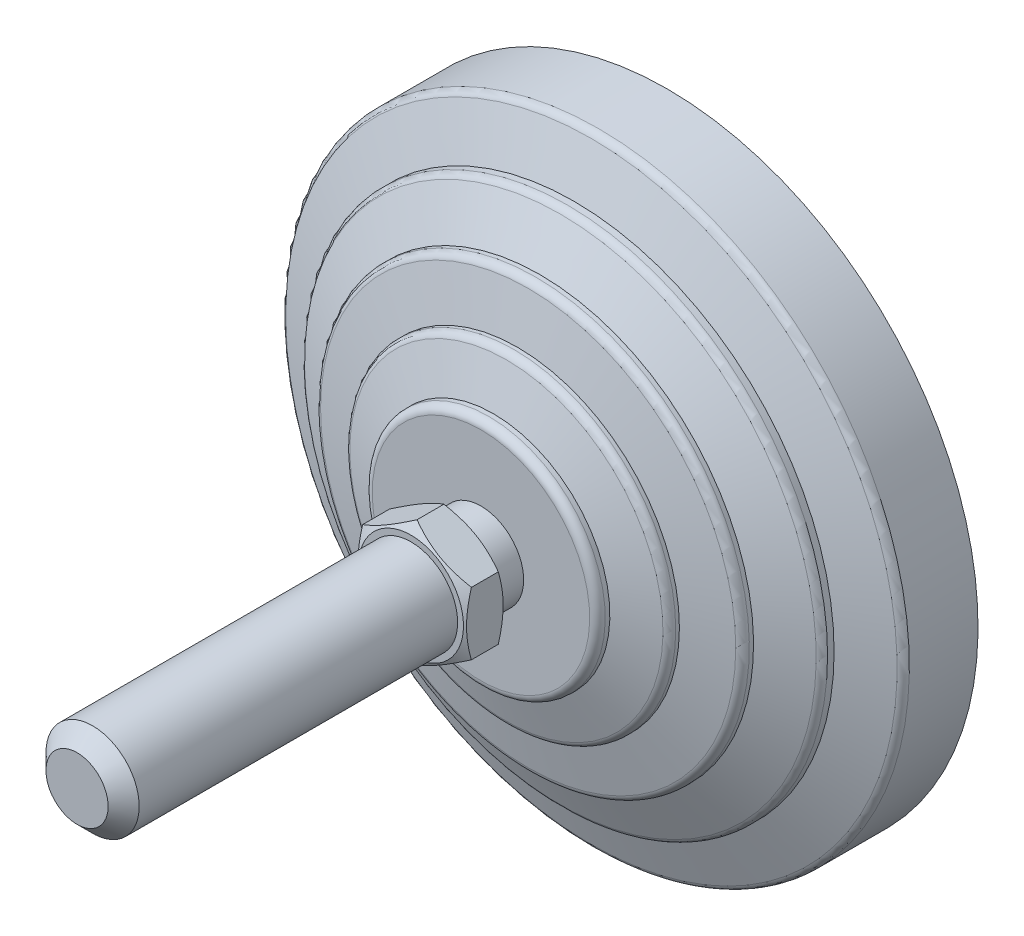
ISO-10303-21;
HEADER;
FILE_DESCRIPTION(('STEP AP214'),'2;1');
FILE_NAME('part.step','',(''),(''),'','','');
FILE_SCHEMA(('AUTOMOTIVE_DESIGN { 1 0 10303 214 1 1 1 1 }'));
ENDSEC;
DATA;
#1=APPLICATION_CONTEXT('core data for automotive mechanical design processes');
#2=APPLICATION_PROTOCOL_DEFINITION('international standard','automotive_design',2000,#1);
#3=PRODUCT_CONTEXT('',#1,'mechanical');
#4=PRODUCT('Part','Part','',(#3));
#5=PRODUCT_RELATED_PRODUCT_CATEGORY('part','',(#4));
#6=PRODUCT_DEFINITION_FORMATION('','',#4);
#7=PRODUCT_DEFINITION_CONTEXT('part definition',#1,'design');
#8=PRODUCT_DEFINITION('design','',#6,#7);
#9=PRODUCT_DEFINITION_SHAPE('','',#8);
#10=(LENGTH_UNIT() NAMED_UNIT(*) SI_UNIT(.MILLI.,.METRE.));
#11=(NAMED_UNIT(*) PLANE_ANGLE_UNIT() SI_UNIT($,.RADIAN.));
#12=(NAMED_UNIT(*) SI_UNIT($,.STERADIAN.) SOLID_ANGLE_UNIT());
#13=UNCERTAINTY_MEASURE_WITH_UNIT(LENGTH_MEASURE(1.E-05),#10,'distance_accuracy_value','');
#14=(GEOMETRIC_REPRESENTATION_CONTEXT(3) GLOBAL_UNCERTAINTY_ASSIGNED_CONTEXT((#13)) GLOBAL_UNIT_ASSIGNED_CONTEXT((#10,
#11,#12)) REPRESENTATION_CONTEXT('',''));
#15=CARTESIAN_POINT('',(0.,0.,0.));
#16=DIRECTION('',(0.,0.,1.));
#17=DIRECTION('',(1.,0.,0.));
#18=AXIS2_PLACEMENT_3D('',#15,#16,#17);
#19=CARTESIAN_POINT('',(-5.5000000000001,0.,31.));
#20=DIRECTION('',(0.,0.,1.));
#21=DIRECTION('',(0.,-1.,0.));
#22=AXIS2_PLACEMENT_3D('',#19,#20,#21);
#23=PLANE('',#22);
#24=CARTESIAN_POINT('',(0.,0.,31.));
#25=DIRECTION('',(0.,0.,-1.));
#26=DIRECTION('',(-1.,0.,0.));
#27=AXIS2_PLACEMENT_3D('',#24,#25,#26);
#28=CIRCLE('',#27,6.75);
#29=CARTESIAN_POINT('',(-6.75,0.,31.));
#30=VERTEX_POINT('',#29);
#31=EDGE_CURVE('E570',#30,#30,#28,.T.);
#32=ORIENTED_EDGE('',*,*,#31,.T.);
#33=EDGE_LOOP('',(#32));
#34=FACE_BOUND('',#33,.T.);
#35=CARTESIAN_POINT('',(0.,0.,31.));
#36=DIRECTION('',(0.,0.,-1.));
#37=DIRECTION('',(0.,1.,0.));
#38=AXIS2_PLACEMENT_3D('',#35,#36,#37);
#39=CIRCLE('',#38,5.5000000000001);
#40=CARTESIAN_POINT('',(0.,5.5000000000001,31.));
#41=VERTEX_POINT('',#40);
#42=EDGE_CURVE('E150',#41,#41,#39,.T.);
#43=ORIENTED_EDGE('',*,*,#42,.F.);
#44=EDGE_LOOP('',(#43));
#45=FACE_BOUND('',#44,.T.);
#46=ADVANCED_FACE('F14',(#34,#45),#23,.F.);
#47=CARTESIAN_POINT('',(0.,0.,0.));
#48=DIRECTION('',(0.,0.,-1.));
#49=DIRECTION('',(0.,1.,0.));
#50=AXIS2_PLACEMENT_3D('',#47,#48,#49);
#51=CYLINDRICAL_SURFACE('',#50,5.5000000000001);
#52=CARTESIAN_POINT('',(0.,0.,27.));
#53=DIRECTION('',(0.,0.,-1.));
#54=DIRECTION('',(0.,1.,0.));
#55=AXIS2_PLACEMENT_3D('',#52,#53,#54);
#56=CIRCLE('',#55,5.5000000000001);
#57=CARTESIAN_POINT('',(0.,5.5000000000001,27.));
#58=VERTEX_POINT('',#57);
#59=EDGE_CURVE('E147',#58,#58,#56,.T.);
#60=ORIENTED_EDGE('',*,*,#59,.F.);
#61=EDGE_LOOP('',(#60));
#62=FACE_BOUND('',#61,.T.);
#63=ORIENTED_EDGE('',*,*,#42,.T.);
#64=EDGE_LOOP('',(#63));
#65=FACE_BOUND('',#64,.T.);
#66=ADVANCED_FACE('F174',(#62,#65),#51,.T.);
#67=CARTESIAN_POINT('',(-5.5000000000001,0.,27.));
#68=DIRECTION('',(0.,0.,-1.));
#69=DIRECTION('',(0.,1.,0.));
#70=AXIS2_PLACEMENT_3D('',#67,#68,#69);
#71=PLANE('',#70);
#72=CARTESIAN_POINT('',(0.,0.,27.));
#73=DIRECTION('',(0.,0.,-1.));
#74=DIRECTION('',(0.,1.,0.));
#75=AXIS2_PLACEMENT_3D('',#72,#73,#74);
#76=CIRCLE('',#75,14.);
#77=CARTESIAN_POINT('',(0.,14.,27.));
#78=VERTEX_POINT('',#77);
#79=EDGE_CURVE('E144',#78,#78,#76,.T.);
#80=ORIENTED_EDGE('',*,*,#79,.F.);
#81=EDGE_LOOP('',(#80));
#82=FACE_BOUND('',#81,.T.);
#83=ORIENTED_EDGE('',*,*,#59,.T.);
#84=EDGE_LOOP('',(#83));
#85=FACE_BOUND('',#84,.T.);
#86=ADVANCED_FACE('F181',(#82,#85),#71,.F.);
#87=CARTESIAN_POINT('',(0.,0.,26.));
#88=DIRECTION('',(0.,0.,-1.));
#89=DIRECTION('',(0.,1.,0.));
#90=AXIS2_PLACEMENT_3D('',#87,#88,#89);
#91=TOROIDAL_SURFACE('',#90,14.,1.);
#92=CARTESIAN_POINT('',(0.,0.,26.));
#93=DIRECTION('',(0.,0.,-1.));
#94=DIRECTION('',(0.,1.,0.));
#95=AXIS2_PLACEMENT_3D('',#92,#93,#94);
#96=CIRCLE('',#95,15.);
#97=CARTESIAN_POINT('',(0.,15.,26.));
#98=VERTEX_POINT('',#97);
#99=EDGE_CURVE('E141',#98,#98,#96,.T.);
#100=ORIENTED_EDGE('',*,*,#99,.F.);
#101=EDGE_LOOP('',(#100));
#102=FACE_BOUND('',#101,.T.);
#103=ORIENTED_EDGE('',*,*,#79,.T.);
#104=EDGE_LOOP('',(#103));
#105=FACE_BOUND('',#104,.T.);
#106=ADVANCED_FACE('F433',(#102,#105),#91,.T.);
#107=CARTESIAN_POINT('',(0.,0.,0.));
#108=DIRECTION('',(0.,0.,-1.));
#109=DIRECTION('',(0.,1.,0.));
#110=AXIS2_PLACEMENT_3D('',#107,#108,#109);
#111=CYLINDRICAL_SURFACE('',#110,15.);
#112=CARTESIAN_POINT('',(0.,0.,25.4025287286));
#113=DIRECTION('',(0.,0.,-1.));
#114=DIRECTION('',(0.,1.,0.));
#115=AXIS2_PLACEMENT_3D('',#112,#113,#114);
#116=CIRCLE('',#115,15.);
#117=CARTESIAN_POINT('',(0.,15.,25.4025287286));
#118=VERTEX_POINT('',#117);
#119=EDGE_CURVE('E138',#118,#118,#116,.T.);
#120=ORIENTED_EDGE('',*,*,#119,.F.);
#121=EDGE_LOOP('',(#120));
#122=FACE_BOUND('',#121,.T.);
#123=ORIENTED_EDGE('',*,*,#99,.T.);
#124=EDGE_LOOP('',(#123));
#125=FACE_BOUND('',#124,.T.);
#126=ADVANCED_FACE('F423',(#122,#125),#111,.T.);
#127=CARTESIAN_POINT('',(0.,0.,25.4025287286));
#128=DIRECTION('',(0.,0.,-1.));
#129=DIRECTION('',(0.,1.,0.));
#130=AXIS2_PLACEMENT_3D('',#127,#128,#129);
#131=CONICAL_SURFACE('',#130,15.,1.25589726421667);
#132=CARTESIAN_POINT('',(0.,0.,23.7216684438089));
#133=DIRECTION('',(0.,0.,-1.));
#134=DIRECTION('',(0.,1.,0.));
#135=AXIS2_PLACEMENT_3D('',#132,#133,#134);
#136=CIRCLE('',#135,20.16016354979);
#137=CARTESIAN_POINT('',(0.,20.16016354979,23.7216684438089));
#138=VERTEX_POINT('',#137);
#139=EDGE_CURVE('E135',#138,#138,#136,.T.);
#140=ORIENTED_EDGE('',*,*,#139,.F.);
#141=EDGE_LOOP('',(#140));
#142=FACE_BOUND('',#141,.T.);
#143=ORIENTED_EDGE('',*,*,#119,.T.);
#144=EDGE_LOOP('',(#143));
#145=FACE_BOUND('',#144,.T.);
#146=ADVANCED_FACE('F413',(#142,#145),#131,.T.);
#147=CARTESIAN_POINT('',(0.,0.,22.7708407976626));
#148=DIRECTION('',(0.,0.,-1.));
#149=DIRECTION('',(0.,1.,0.));
#150=AXIS2_PLACEMENT_3D('',#147,#148,#149);
#151=TOROIDAL_SURFACE('',#150,19.8504430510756,1.);
#152=CARTESIAN_POINT('',(0.,0.,22.7708407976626));
#153=DIRECTION('',(0.,0.,-1.));
#154=DIRECTION('',(0.,1.,0.));
#155=AXIS2_PLACEMENT_3D('',#152,#153,#154);
#156=CIRCLE('',#155,20.8504430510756);
#157=CARTESIAN_POINT('',(0.,20.8504430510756,22.7708407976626));
#158=VERTEX_POINT('',#157);
#159=EDGE_CURVE('E132',#158,#158,#156,.T.);
#160=ORIENTED_EDGE('',*,*,#159,.F.);
#161=EDGE_LOOP('',(#160));
#162=FACE_BOUND('',#161,.T.);
#163=ORIENTED_EDGE('',*,*,#139,.T.);
#164=EDGE_LOOP('',(#163));
#165=FACE_BOUND('',#164,.T.);
#166=ADVANCED_FACE('F403',(#162,#165),#151,.T.);
#167=CARTESIAN_POINT('',(0.,0.,0.));
#168=DIRECTION('',(0.,0.,-1.));
#169=DIRECTION('',(0.,1.,0.));
#170=AXIS2_PLACEMENT_3D('',#167,#168,#169);
#171=CYLINDRICAL_SURFACE('',#170,20.8504430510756);
#172=CARTESIAN_POINT('',(0.,0.,22.2987385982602));
#173=DIRECTION('',(0.,0.,-1.));
#174=DIRECTION('',(0.,1.,0.));
#175=AXIS2_PLACEMENT_3D('',#172,#173,#174);
#176=CIRCLE('',#175,20.8504430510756);
#177=CARTESIAN_POINT('',(0.,20.8504430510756,22.2987385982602));
#178=VERTEX_POINT('',#177);
#179=EDGE_CURVE('E129',#178,#178,#176,.T.);
#180=ORIENTED_EDGE('',*,*,#179,.F.);
#181=EDGE_LOOP('',(#180));
#182=FACE_BOUND('',#181,.T.);
#183=ORIENTED_EDGE('',*,*,#159,.T.);
#184=EDGE_LOOP('',(#183));
#185=FACE_BOUND('',#184,.T.);
#186=ADVANCED_FACE('F393',(#182,#185),#171,.T.);
#187=CARTESIAN_POINT('',(0.,0.,22.2987385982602));
#188=DIRECTION('',(0.,0.,-1.));
#189=DIRECTION('',(0.,1.,0.));
#190=AXIS2_PLACEMENT_3D('',#187,#188,#189);
#191=CONICAL_SURFACE('',#190,20.8504430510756,1.34067144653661);
#192=CARTESIAN_POINT('',(0.,0.,20.9217501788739));
#193=DIRECTION('',(0.,0.,-1.));
#194=DIRECTION('',(0.,1.,0.));
#195=AXIS2_PLACEMENT_3D('',#192,#193,#194);
#196=CIRCLE('',#195,26.7280991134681);
#197=CARTESIAN_POINT('',(0.,26.7280991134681,20.9217501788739));
#198=VERTEX_POINT('',#197);
#199=EDGE_CURVE('E126',#198,#198,#196,.T.);
#200=ORIENTED_EDGE('',*,*,#199,.F.);
#201=EDGE_LOOP('',(#200));
#202=FACE_BOUND('',#201,.T.);
#203=ORIENTED_EDGE('',*,*,#179,.T.);
#204=EDGE_LOOP('',(#203));
#205=FACE_BOUND('',#204,.T.);
#206=ADVANCED_FACE('F383',(#202,#205),#191,.T.);
#207=CARTESIAN_POINT('',(0.,0.,19.9481122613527));
#208=DIRECTION('',(0.,0.,-1.));
#209=DIRECTION('',(0.,1.,0.));
#210=AXIS2_PLACEMENT_3D('',#207,#208,#209);
#211=TOROIDAL_SURFACE('',#210,26.5,1.00000000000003);
#212=CARTESIAN_POINT('',(0.,0.,19.9481122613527));
#213=DIRECTION('',(0.,0.,-1.));
#214=DIRECTION('',(0.,1.,0.));
#215=AXIS2_PLACEMENT_3D('',#212,#213,#214);
#216=CIRCLE('',#215,27.5);
#217=CARTESIAN_POINT('',(0.,27.5,19.9481122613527));
#218=VERTEX_POINT('',#217);
#219=EDGE_CURVE('E123',#218,#218,#216,.T.);
#220=ORIENTED_EDGE('',*,*,#219,.F.);
#221=EDGE_LOOP('',(#220));
#222=FACE_BOUND('',#221,.T.);
#223=ORIENTED_EDGE('',*,*,#199,.T.);
#224=EDGE_LOOP('',(#223));
#225=FACE_BOUND('',#224,.T.);
#226=ADVANCED_FACE('F373',(#222,#225),#211,.T.);
#227=CARTESIAN_POINT('',(0.,0.,0.));
#228=DIRECTION('',(0.,0.,-1.));
#229=DIRECTION('',(0.,1.,0.));
#230=AXIS2_PLACEMENT_3D('',#227,#228,#229);
#231=CYLINDRICAL_SURFACE('',#230,27.5);
#232=CARTESIAN_POINT('',(0.,0.,19.4025287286));
#233=DIRECTION('',(0.,0.,-1.));
#234=DIRECTION('',(0.,1.,0.));
#235=AXIS2_PLACEMENT_3D('',#232,#233,#234);
#236=CIRCLE('',#235,27.5);
#237=CARTESIAN_POINT('',(0.,27.5,19.4025287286));
#238=VERTEX_POINT('',#237);
#239=EDGE_CURVE('E120',#238,#238,#236,.T.);
#240=ORIENTED_EDGE('',*,*,#239,.F.);
#241=EDGE_LOOP('',(#240));
#242=FACE_BOUND('',#241,.T.);
#243=ORIENTED_EDGE('',*,*,#219,.T.);
#244=EDGE_LOOP('',(#243));
#245=FACE_BOUND('',#244,.T.);
#246=ADVANCED_FACE('F363',(#242,#245),#231,.T.);
#247=CARTESIAN_POINT('',(0.,0.,19.4025287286));
#248=DIRECTION('',(0.,0.,-1.));
#249=DIRECTION('',(0.,1.,0.));
#250=AXIS2_PLACEMENT_3D('',#247,#248,#249);
#251=CONICAL_SURFACE('',#250,27.5,1.1202291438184);
#252=CARTESIAN_POINT('',(0.,0.,16.7730910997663));
#253=DIRECTION('',(0.,0.,-1.));
#254=DIRECTION('',(0.,1.,0.));
#255=AXIS2_PLACEMENT_3D('',#252,#253,#254);
#256=CIRCLE('',#255,32.9354761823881);
#257=CARTESIAN_POINT('',(0.,32.9354761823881,16.7730910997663));
#258=VERTEX_POINT('',#257);
#259=EDGE_CURVE('E117',#258,#258,#256,.T.);
#260=ORIENTED_EDGE('',*,*,#259,.F.);
#261=EDGE_LOOP('',(#260));
#262=FACE_BOUND('',#261,.T.);
#263=ORIENTED_EDGE('',*,*,#239,.T.);
#264=EDGE_LOOP('',(#263));
#265=FACE_BOUND('',#264,.T.);
#266=ADVANCED_FACE('F353',(#262,#265),#251,.T.);
#267=CARTESIAN_POINT('',(0.,0.,15.8728908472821));
#268=DIRECTION('',(0.,0.,-1.));
#269=DIRECTION('',(0.,1.,0.));
#270=AXIS2_PLACEMENT_3D('',#267,#268,#269);
#271=TOROIDAL_SURFACE('',#270,32.5,0.999999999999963);
#272=CARTESIAN_POINT('',(0.,0.,15.8728908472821));
#273=DIRECTION('',(0.,0.,-1.));
#274=DIRECTION('',(0.,1.,0.));
#275=AXIS2_PLACEMENT_3D('',#272,#273,#274);
#276=CIRCLE('',#275,33.5);
#277=CARTESIAN_POINT('',(0.,33.5,15.8728908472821));
#278=VERTEX_POINT('',#277);
#279=EDGE_CURVE('E114',#278,#278,#276,.T.);
#280=ORIENTED_EDGE('',*,*,#279,.F.);
#281=EDGE_LOOP('',(#280));
#282=FACE_BOUND('',#281,.T.);
#283=ORIENTED_EDGE('',*,*,#259,.T.);
#284=EDGE_LOOP('',(#283));
#285=FACE_BOUND('',#284,.T.);
#286=ADVANCED_FACE('F343',(#282,#285),#271,.T.);
#287=CARTESIAN_POINT('',(0.,0.,0.));
#288=DIRECTION('',(0.,0.,-1.));
#289=DIRECTION('',(0.,1.,0.));
#290=AXIS2_PLACEMENT_3D('',#287,#288,#289);
#291=CYLINDRICAL_SURFACE('',#290,33.5);
#292=CARTESIAN_POINT('',(0.,0.,15.0315037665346));
#293=DIRECTION('',(0.,0.,-1.));
#294=DIRECTION('',(0.,1.,0.));
#295=AXIS2_PLACEMENT_3D('',#292,#293,#294);
#296=CIRCLE('',#295,33.5);
#297=CARTESIAN_POINT('',(0.,33.5,15.0315037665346));
#298=VERTEX_POINT('',#297);
#299=EDGE_CURVE('E111',#298,#298,#296,.T.);
#300=ORIENTED_EDGE('',*,*,#299,.F.);
#301=EDGE_LOOP('',(#300));
#302=FACE_BOUND('',#301,.T.);
#303=ORIENTED_EDGE('',*,*,#279,.T.);
#304=EDGE_LOOP('',(#303));
#305=FACE_BOUND('',#304,.T.);
#306=ADVANCED_FACE('F333',(#302,#305),#291,.T.);
#307=CARTESIAN_POINT('',(0.,0.,15.0315037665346));
#308=DIRECTION('',(0.,0.,-1.));
#309=DIRECTION('',(0.,1.,0.));
#310=AXIS2_PLACEMENT_3D('',#307,#308,#309);
#311=CONICAL_SURFACE('',#310,33.5,1.20362249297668);
#312=CARTESIAN_POINT('',(0.,0.,12.7780502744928));
#313=DIRECTION('',(0.,0.,-1.));
#314=DIRECTION('',(0.,1.,0.));
#315=AXIS2_PLACEMENT_3D('',#312,#313,#314);
#316=CIRCLE('',#315,39.3589790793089);
#317=CARTESIAN_POINT('',(0.,39.3589790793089,12.7780502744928));
#318=VERTEX_POINT('',#317);
#319=EDGE_CURVE('E108',#318,#318,#316,.T.);
#320=ORIENTED_EDGE('',*,*,#319,.F.);
#321=EDGE_LOOP('',(#320));
#322=FACE_BOUND('',#321,.T.);
#323=ORIENTED_EDGE('',*,*,#299,.T.);
#324=EDGE_LOOP('',(#323));
#325=FACE_BOUND('',#324,.T.);
#326=ADVANCED_FACE('F323',(#322,#325),#311,.T.);
#327=CARTESIAN_POINT('',(0.,0.,11.8447046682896));
#328=DIRECTION('',(0.,0.,-1.));
#329=DIRECTION('',(0.,1.,0.));
#330=AXIS2_PLACEMENT_3D('',#327,#328,#329);
#331=TOROIDAL_SURFACE('',#330,39.,1.00000000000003);
#332=CARTESIAN_POINT('',(0.,0.,11.8447046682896));
#333=DIRECTION('',(0.,0.,-1.));
#334=DIRECTION('',(0.,1.,0.));
#335=AXIS2_PLACEMENT_3D('',#332,#333,#334);
#336=CIRCLE('',#335,40.);
#337=CARTESIAN_POINT('',(0.,40.,11.8447046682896));
#338=VERTEX_POINT('',#337);
#339=EDGE_CURVE('E105',#338,#338,#336,.T.);
#340=ORIENTED_EDGE('',*,*,#339,.F.);
#341=EDGE_LOOP('',(#340));
#342=FACE_BOUND('',#341,.T.);
#343=ORIENTED_EDGE('',*,*,#319,.T.);
#344=EDGE_LOOP('',(#343));
#345=FACE_BOUND('',#344,.T.);
#346=ADVANCED_FACE('F313',(#342,#345),#331,.T.);
#347=CARTESIAN_POINT('',(0.,0.,0.));
#348=DIRECTION('',(0.,0.,-1.));
#349=DIRECTION('',(0.,1.,0.));
#350=AXIS2_PLACEMENT_3D('',#347,#348,#349);
#351=CYLINDRICAL_SURFACE('',#350,40.);
#352=CARTESIAN_POINT('',(0.,0.,3.00000000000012));
#353=DIRECTION('',(0.,0.,-1.));
#354=DIRECTION('',(0.,1.,0.));
#355=AXIS2_PLACEMENT_3D('',#352,#353,#354);
#356=CIRCLE('',#355,40.);
#357=CARTESIAN_POINT('',(0.,40.,3.00000000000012));
#358=VERTEX_POINT('',#357);
#359=EDGE_CURVE('E102',#358,#358,#356,.T.);
#360=ORIENTED_EDGE('',*,*,#359,.F.);
#361=EDGE_LOOP('',(#360));
#362=FACE_BOUND('',#361,.T.);
#363=ORIENTED_EDGE('',*,*,#339,.T.);
#364=EDGE_LOOP('',(#363));
#365=FACE_BOUND('',#364,.T.);
#366=ADVANCED_FACE('F303',(#362,#365),#351,.T.);
#367=CARTESIAN_POINT('',(-33.5,0.,3.00000000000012));
#368=DIRECTION('',(0.,0.,1.));
#369=DIRECTION('',(0.,-1.,0.));
#370=AXIS2_PLACEMENT_3D('',#367,#368,#369);
#371=PLANE('',#370);
#372=CARTESIAN_POINT('',(0.,0.,3.00000000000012));
#373=DIRECTION('',(0.,0.,-1.));
#374=DIRECTION('',(0.,1.,0.));
#375=AXIS2_PLACEMENT_3D('',#372,#373,#374);
#376=CIRCLE('',#375,33.5);
#377=CARTESIAN_POINT('',(0.,33.5,3.00000000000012));
#378=VERTEX_POINT('',#377);
#379=EDGE_CURVE('E99',#378,#378,#376,.T.);
#380=ORIENTED_EDGE('',*,*,#379,.F.);
#381=EDGE_LOOP('',(#380));
#382=FACE_BOUND('',#381,.T.);
#383=ORIENTED_EDGE('',*,*,#359,.T.);
#384=EDGE_LOOP('',(#383));
#385=FACE_BOUND('',#384,.T.);
#386=ADVANCED_FACE('F293',(#382,#385),#371,.F.);
#387=CARTESIAN_POINT('',(0.,0.,0.));
#388=DIRECTION('',(0.,0.,-1.));
#389=DIRECTION('',(0.,1.,0.));
#390=AXIS2_PLACEMENT_3D('',#387,#388,#389);
#391=CYLINDRICAL_SURFACE('',#390,33.5);
#392=CARTESIAN_POINT('',(0.,0.,0.));
#393=DIRECTION('',(0.,0.,-1.));
#394=DIRECTION('',(0.,1.,0.));
#395=AXIS2_PLACEMENT_3D('',#392,#393,#394);
#396=CIRCLE('',#395,33.5);
#397=CARTESIAN_POINT('',(0.,33.5,0.));
#398=VERTEX_POINT('',#397);
#399=EDGE_CURVE('E96',#398,#398,#396,.T.);
#400=ORIENTED_EDGE('',*,*,#399,.F.);
#401=EDGE_LOOP('',(#400));
#402=FACE_BOUND('',#401,.T.);
#403=ORIENTED_EDGE('',*,*,#379,.T.);
#404=EDGE_LOOP('',(#403));
#405=FACE_BOUND('',#404,.T.);
#406=ADVANCED_FACE('F282',(#402,#405),#391,.T.);
#407=CARTESIAN_POINT('',(0.,0.,0.));
#408=DIRECTION('',(0.,0.,1.));
#409=DIRECTION('',(0.,-1.,0.));
#410=AXIS2_PLACEMENT_3D('',#407,#408,#409);
#411=PLANE('',#410);
#412=ORIENTED_EDGE('',*,*,#399,.T.);
#413=EDGE_LOOP('',(#412));
#414=FACE_BOUND('',#413,.T.);
#415=ADVANCED_FACE('F172',(#414),#411,.F.);
#416=CARTESIAN_POINT('',(0.,0.,32.378061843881));
#417=DIRECTION('',(0.,0.,1.));
#418=DIRECTION('',(1.,0.,0.));
#419=AXIS2_PLACEMENT_3D('',#416,#417,#418);
#420=CONICAL_SURFACE('',#419,9.13687312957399,1.0471975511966);
#421=CARTESIAN_POINT('',(0.257921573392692,-8.23181485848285,31.8578584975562));
#422=CARTESIAN_POINT('',(-0.0687389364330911,-8.04321732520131,31.7431059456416));
#423=CARTESIAN_POINT('',(-0.398454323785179,-7.85285605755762,31.6380759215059));
#424=CARTESIAN_POINT('',(-1.06426581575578,-7.46844961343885,31.4536761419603));
#425=CARTESIAN_POINT('',(-1.40037879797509,-7.2743946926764,31.3743885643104));
#426=CARTESIAN_POINT('',(-1.90313011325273,-6.98413108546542,31.2808722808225));
#427=CARTESIAN_POINT('',(-2.06802000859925,-6.88893186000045,31.2541562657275));
#428=CARTESIAN_POINT('',(-2.39866339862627,-6.69803480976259,31.2090748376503));
#429=CARTESIAN_POINT('',(-2.56441690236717,-6.60233697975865,31.1907095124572));
#430=CARTESIAN_POINT('',(-2.89621764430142,-6.41077173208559,31.1628535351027));
#431=CARTESIAN_POINT('',(-3.06226397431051,-6.3149048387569,31.1533485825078));
#432=CARTESIAN_POINT('',(-3.3945612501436,-6.12305291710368,31.1434339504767));
#433=CARTESIAN_POINT('',(-3.56081219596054,-6.02706788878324,31.1430242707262));
#434=CARTESIAN_POINT('',(-3.90349341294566,-5.82922079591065,31.1515726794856));
#435=CARTESIAN_POINT('',(-4.07991284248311,-5.72736499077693,31.1611157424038));
#436=CARTESIAN_POINT('',(-4.43213324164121,-5.52401044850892,31.1901733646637));
#437=CARTESIAN_POINT('',(-4.60793419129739,-5.42251172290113,31.2096882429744));
#438=CARTESIAN_POINT('',(-4.95888623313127,-5.2198894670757,31.2581400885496));
#439=CARTESIAN_POINT('',(-5.13403548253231,-5.11876700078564,31.2870946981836));
#440=CARTESIAN_POINT('',(-5.48310478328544,-4.91723174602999,31.3536225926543));
#441=CARTESIAN_POINT('',(-5.65702474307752,-4.81681901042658,31.3911965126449));
#442=CARTESIAN_POINT('',(-6.0090012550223,-4.61360527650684,31.4753875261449));
#443=CARTESIAN_POINT('',(-6.18701258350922,-4.51083038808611,31.5222550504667));
#444=CARTESIAN_POINT('',(-6.54150268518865,-4.30616543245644,31.623212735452));
#445=CARTESIAN_POINT('',(-6.71798129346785,-4.20427546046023,31.6773036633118));
#446=CARTESIAN_POINT('',(-7.06867274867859,-4.00180365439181,31.7915047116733));
#447=CARTESIAN_POINT('',(-7.24289194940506,-3.90121815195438,31.8515889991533));
#448=CARTESIAN_POINT('',(-7.58981206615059,-3.70092372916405,31.9771006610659));
#449=CARTESIAN_POINT('',(-7.76251352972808,-3.60121449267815,32.0425260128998));
#450=CARTESIAN_POINT('',(-7.93452560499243,-3.50190327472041,32.1102144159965));
#451=B_SPLINE_CURVE_WITH_KNOTS('',3,(#421,#422,#423,#424,#425,#426,#427,#428,#429,#430,#431,
#432,#433,#434,#435,#436,#437,#438,#439,#440,#441,#442,#443,#444,#445,#446,#447,#448,#449,#450),
.UNSPECIFIED.,.F.,.F.,(4,2,2,2,2,2,2,2,2,2,2,2,2,2,4),(0.,1.18353738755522,2.3708166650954,
2.94743875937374,3.5240669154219,4.09976278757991,4.67545863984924,5.28700642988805,
5.89857378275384,6.51129073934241,7.12405286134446,7.75637953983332,8.3887734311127,
9.01855053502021,9.6480902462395),.UNSPECIFIED.);
#452=CARTESIAN_POINT('',(0.,-8.08290376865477,31.7695523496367));
#453=VERTEX_POINT('',#452);
#454=CARTESIAN_POINT('',(-7.,-4.04145188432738,31.7695523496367));
#455=VERTEX_POINT('',#454);
#456=EDGE_CURVE('E73',#453,#455,#451,.T.);
#457=ORIENTED_EDGE('',*,*,#456,.T.);
#458=CARTESIAN_POINT('',(-7.,-10.783041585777,34.5252389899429));
#459=CARTESIAN_POINT('',(-7.,-10.4779064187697,34.3775152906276));
#460=CARTESIAN_POINT('',(-7.,-10.1720629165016,34.2312292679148));
#461=CARTESIAN_POINT('',(-7.,-9.55858224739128,33.9423426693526));
#462=CARTESIAN_POINT('',(-7.,-9.25094480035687,33.7997426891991));
#463=CARTESIAN_POINT('',(-7.,-8.63187899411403,33.5183051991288));
#464=CARTESIAN_POINT('',(-7.,-8.32043906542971,33.3794930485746));
#465=CARTESIAN_POINT('',(-7.,-7.69505651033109,33.1076476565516));
#466=CARTESIAN_POINT('',(-7.,-7.38111400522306,32.9746141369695));
#467=CARTESIAN_POINT('',(-7.,-6.74038245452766,32.7118165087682));
#468=CARTESIAN_POINT('',(-7.,-6.41349803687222,32.5822836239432));
#469=CARTESIAN_POINT('',(-7.,-5.75587888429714,32.3331988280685));
#470=CARTESIAN_POINT('',(-7.,-5.42514371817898,32.2136480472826));
#471=CARTESIAN_POINT('',(-7.,-4.75993582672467,31.9877197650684));
#472=CARTESIAN_POINT('',(-7.,-4.42547247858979,31.8813149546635));
#473=CARTESIAN_POINT('',(-7.,-3.75176126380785,31.6851392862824));
#474=CARTESIAN_POINT('',(-7.,-3.41251496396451,31.5953631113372));
#475=CARTESIAN_POINT('',(-7.,-2.73085480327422,31.4372798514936));
#476=CARTESIAN_POINT('',(-7.,-2.38846800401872,31.3688592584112));
#477=CARTESIAN_POINT('',(-7.,-1.8718290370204,31.2852437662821));
#478=CARTESIAN_POINT('',(-7.,-1.69909300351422,31.2605400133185));
#479=CARTESIAN_POINT('',(-7.,-1.35278734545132,31.2179570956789));
#480=CARTESIAN_POINT('',(-7.,-1.17921780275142,31.2000772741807));
#481=CARTESIAN_POINT('',(-7.,-0.833712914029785,31.1717189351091));
#482=CARTESIAN_POINT('',(-7.,-0.661785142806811,31.1611484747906));
#483=CARTESIAN_POINT('',(-7.,-0.317636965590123,31.1472822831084));
#484=CARTESIAN_POINT('',(-7.,-0.145416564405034,31.1439864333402));
#485=CARTESIAN_POINT('',(-7.,0.199009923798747,31.1447479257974));
#486=CARTESIAN_POINT('',(-7.,0.371216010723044,31.1488053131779));
#487=CARTESIAN_POINT('',(-7.,0.715306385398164,31.1641754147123));
#488=CARTESIAN_POINT('',(-7.,0.887190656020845,31.1754885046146));
#489=CARTESIAN_POINT('',(-7.,1.30251349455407,31.2113535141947));
#490=CARTESIAN_POINT('',(-7.,1.5456503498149,31.2394718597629));
#491=CARTESIAN_POINT('',(-7.,2.03005985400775,31.3086753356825));
#492=CARTESIAN_POINT('',(-7.,2.27133223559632,31.3497622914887));
#493=CARTESIAN_POINT('',(-7.,2.99211035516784,31.4902922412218));
#494=CARTESIAN_POINT('',(-7.,3.46829564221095,31.6069768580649));
#495=CARTESIAN_POINT('',(-7.,4.18022630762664,31.808564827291));
#496=CARTESIAN_POINT('',(-7.,4.41968311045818,31.8811082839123));
#497=CARTESIAN_POINT('',(-7.,4.8962697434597,32.0335417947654));
#498=CARTESIAN_POINT('',(-7.,5.13339955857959,32.1134318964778));
#499=CARTESIAN_POINT('',(-7.,5.60541048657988,32.2792925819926));
#500=CARTESIAN_POINT('',(-7.,5.84029235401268,32.3652610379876));
#501=CARTESIAN_POINT('',(-7.,6.30812276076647,32.5422857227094));
#502=CARTESIAN_POINT('',(-7.,6.54107131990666,32.6333418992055));
#503=CARTESIAN_POINT('',(-7.,7.07894287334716,32.8492782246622));
#504=CARTESIAN_POINT('',(-7.,7.38323792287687,32.9757193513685));
#505=CARTESIAN_POINT('',(-7.,7.98934167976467,33.2344429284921));
#506=CARTESIAN_POINT('',(-7.,8.29115025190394,33.3667256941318));
#507=CARTESIAN_POINT('',(-7.,8.89272323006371,33.6359920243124));
#508=CARTESIAN_POINT('',(-7.,9.19248725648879,33.7729764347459));
#509=CARTESIAN_POINT('',(-7.,9.79025876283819,34.0507322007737));
#510=CARTESIAN_POINT('',(-7.,10.08826620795,34.1915036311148));
#511=CARTESIAN_POINT('',(-7.,10.6830918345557,34.4762790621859));
#512=CARTESIAN_POINT('',(-7.,10.9799085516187,34.6202861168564));
#513=CARTESIAN_POINT('',(-7.,11.5722865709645,34.9108618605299));
#514=CARTESIAN_POINT('',(-7.,11.8678478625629,35.05743057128));
#515=CARTESIAN_POINT('',(-7.,12.7528699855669,35.500279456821));
#516=CARTESIAN_POINT('',(-7.,13.3407408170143,35.7997370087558));
#517=CARTESIAN_POINT('',(-7.,14.4661899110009,36.380320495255));
#518=CARTESIAN_POINT('',(-7.,15.0040085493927,36.66098249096));
#519=CARTESIAN_POINT('',(-7.,16.0776388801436,37.2261574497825));
#520=CARTESIAN_POINT('',(-7.,16.613450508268,37.5106705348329));
#521=CARTESIAN_POINT('',(-7.,17.682257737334,38.0819784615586));
#522=CARTESIAN_POINT('',(-7.,18.2152569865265,38.3687664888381));
#523=CARTESIAN_POINT('',(-7.,19.2799651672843,38.9446636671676));
#524=CARTESIAN_POINT('',(-7.,19.811674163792,39.2337726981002));
#525=CARTESIAN_POINT('',(-7.,20.342904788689,39.523752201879));
#526=B_SPLINE_CURVE_WITH_KNOTS('',3,(#458,#459,#460,#461,#462,#463,#464,#465,#466,#467,#468,
#469,#470,#471,#472,#473,#474,#475,#476,#477,#478,#479,#480,#481,#482,#483,#484,#485,#486,#487,
#488,#489,#490,#491,#492,#493,#494,#495,#496,#497,#498,#499,#500,#501,#502,#503,#504,#505,#506,
#507,#508,#509,#510,#511,#512,#513,#514,#515,#516,#517,#518,#519,#520,#521,#522,#523,#524,#525),
.UNSPECIFIED.,.F.,.F.,(4,2,2,2,2,2,2,2,2,2,2,2,2,2,2,2,2,2,2,2,2,2,2,2,2,2,2,2,2,2,2,2,2,4),(0.,
1.01705154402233,2.03426643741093,3.05714308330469,4.07997044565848,5.13468508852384,
6.18951899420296,7.24212340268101,8.29439066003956,9.34096576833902,9.86433291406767,
10.3876496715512,10.9042577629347,11.4208574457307,11.9374603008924,12.4540899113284,
13.1879458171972,13.9219050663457,15.3906680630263,16.1412203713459,16.8917775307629,
17.642073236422,18.3923612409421,19.3808376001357,20.369367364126,21.3580759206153,
22.3468040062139,23.3365081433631,24.3262206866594,26.3054067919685,28.1253297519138,
29.9453104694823,31.7610742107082,33.5767445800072),.UNSPECIFIED.);
#527=CARTESIAN_POINT('',(-7.,4.04145188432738,31.7695523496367));
#528=VERTEX_POINT('',#527);
#529=EDGE_CURVE('E81',#455,#528,#526,.T.);
#530=ORIENTED_EDGE('',*,*,#529,.T.);
#531=CARTESIAN_POINT('',(-12.6571094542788,0.775318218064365,34.4241683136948));
#532=CARTESIAN_POINT('',(-12.3891127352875,0.930046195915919,34.2752378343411));
#533=CARTESIAN_POINT('',(-12.1204614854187,1.0851520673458,34.1278476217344));
#534=CARTESIAN_POINT('',(-11.5814893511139,1.39632777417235,33.8370445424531));
#535=CARTESIAN_POINT('',(-11.3111681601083,1.5523977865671,33.6936324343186));
#536=CARTESIAN_POINT('',(-10.7668821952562,1.86664143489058,33.4108486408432));
#537=CARTESIAN_POINT('',(-10.4929051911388,2.02482213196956,33.2715082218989));
#538=CARTESIAN_POINT('',(-9.94261460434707,2.34253255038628,32.9991468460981));
#539=CARTESIAN_POINT('',(-9.6663011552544,2.50206219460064,32.8661255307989));
#540=CARTESIAN_POINT('',(-9.10840278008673,2.82416497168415,32.6069761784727));
#541=CARTESIAN_POINT('',(-8.82679284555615,2.98675254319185,32.480919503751));
#542=CARTESIAN_POINT('',(-8.26014775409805,3.31390523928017,32.2393153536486));
#543=CARTESIAN_POINT('',(-7.97511219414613,3.47847059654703,32.1237691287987));
#544=CARTESIAN_POINT('',(-7.40182588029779,3.80945760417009,31.9065314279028));
#545=CARTESIAN_POINT('',(-7.11358454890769,3.97587381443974,31.804807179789));
#546=CARTESIAN_POINT('',(-6.53297722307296,4.3110876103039,31.6187437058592));
#547=CARTESIAN_POINT('',(-6.24061268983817,4.4798843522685,31.5343984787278));
#548=CARTESIAN_POINT('',(-5.65545599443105,4.81772472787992,31.3884435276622));
#549=CARTESIAN_POINT('',(-5.36271715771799,4.98673757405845,31.3265567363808));
#550=CARTESIAN_POINT('',(-4.92122151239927,5.24163520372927,31.2528260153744));
#551=CARTESIAN_POINT('',(-4.7736388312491,5.32684210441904,31.2314307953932));
#552=CARTESIAN_POINT('',(-4.47785817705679,5.49761114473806,31.1954310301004));
#553=CARTESIAN_POINT('',(-4.32966026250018,5.58317325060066,31.180825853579));
#554=CARTESIAN_POINT('',(-4.03368019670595,5.75405742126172,31.1587896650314));
#555=CARTESIAN_POINT('',(-3.88590022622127,5.83937822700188,31.1513197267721));
#556=CARTESIAN_POINT('',(-3.5901998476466,6.01010092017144,31.1435848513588));
#557=CARTESIAN_POINT('',(-3.4422794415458,6.09550280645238,31.1433198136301));
#558=CARTESIAN_POINT('',(-3.14659770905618,6.26621473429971,31.1500008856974));
#559=CARTESIAN_POINT('',(-2.99883635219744,6.35152479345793,31.1569451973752));
#560=CARTESIAN_POINT('',(-2.70368622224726,6.52192980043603,31.1778809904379));
#561=CARTESIAN_POINT('',(-2.55629747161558,6.60702473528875,31.1918728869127));
#562=CARTESIAN_POINT('',(-2.19205509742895,6.81732016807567,31.2348795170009));
#563=CARTESIAN_POINT('',(-1.97554780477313,6.94232071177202,31.2678752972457));
#564=CARTESIAN_POINT('',(-1.54437685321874,7.19125737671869,31.3471746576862));
#565=CARTESIAN_POINT('',(-1.32971350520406,7.31519331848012,31.3934804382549));
#566=CARTESIAN_POINT('',(-0.688040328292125,7.68566349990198,31.5500195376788));
#567=CARTESIAN_POINT('',(-0.2642045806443,7.93036518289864,31.677761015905));
#568=CARTESIAN_POINT('',(0.369387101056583,8.29616951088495,31.8958679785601));
#569=CARTESIAN_POINT('',(0.582494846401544,8.41920732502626,31.9739711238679));
#570=CARTESIAN_POINT('',(1.00665303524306,8.66409516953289,32.1374318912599));
#571=CARTESIAN_POINT('',(1.21770330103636,8.78594509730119,32.222790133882));
#572=CARTESIAN_POINT('',(1.63668728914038,9.0278456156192,32.3989735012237));
#573=CARTESIAN_POINT('',(1.84463196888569,9.1479025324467,32.4897642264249));
#574=CARTESIAN_POINT('',(2.25878701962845,9.38701506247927,32.6762567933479));
#575=CARTESIAN_POINT('',(2.46499794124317,9.50607099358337,32.7719570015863));
#576=CARTESIAN_POINT('',(2.6704844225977,9.62470866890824,32.8696439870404));
#577=B_SPLINE_CURVE_WITH_KNOTS('',3,(#531,#532,#533,#534,#535,#536,#537,#538,#539,#540,#541,
#542,#543,#544,#545,#546,#547,#548,#549,#550,#551,#552,#553,#554,#555,#556,#557,#558,#559,#560,
#561,#562,#563,#564,#565,#566,#567,#568,#569,#570,#571,#572,#573,#574,#575,#576),.UNSPECIFIED.,
.F.,.F.,(4,2,2,2,2,2,2,2,2,2,2,2,2,2,2,2,2,2,2,2,2,2,4),(0.,1.03030139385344,2.06079791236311,
3.09780764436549,4.1347584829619,5.18087940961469,6.22712464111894,7.27084423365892,
8.31420280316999,9.34421287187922,9.85935343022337,10.3744460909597,10.8867123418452,
11.3989714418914,11.9111028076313,12.423264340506,13.1793365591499,13.935533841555,
15.4509042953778,16.2253705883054,16.999903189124,17.7699650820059,18.5397724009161),.UNSPECIFIED.);
#578=CARTESIAN_POINT('',(0.,8.08290376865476,31.7695523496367));
#579=VERTEX_POINT('',#578);
#580=EDGE_CURVE('E525',#528,#579,#577,.T.);
#581=ORIENTED_EDGE('',*,*,#580,.T.);
#582=CARTESIAN_POINT('',(-0.940485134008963,8.62589311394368,32.1125611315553));
#583=CARTESIAN_POINT('',(-0.768388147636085,8.52653287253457,32.0447801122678));
#584=CARTESIAN_POINT('',(-0.595601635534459,8.42677453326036,31.9792606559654));
#585=CARTESIAN_POINT('',(-0.248510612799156,8.22638143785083,31.8535581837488));
#586=CARTESIAN_POINT('',(-0.0742055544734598,8.12574636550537,31.7933771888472));
#587=CARTESIAN_POINT('',(0.276660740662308,7.92317361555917,31.6789796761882));
#588=CARTESIAN_POINT('',(0.453228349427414,7.82123225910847,31.6247890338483));
#589=CARTESIAN_POINT('',(0.807898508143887,7.61646334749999,31.5236308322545));
#590=CARTESIAN_POINT('',(0.98600089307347,7.51363588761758,31.4766625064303));
#591=CARTESIAN_POINT('',(1.33815654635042,7.31031872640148,31.3922742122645));
#592=CARTESIAN_POINT('',(1.51216448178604,7.2098551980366,31.3546036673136));
#593=CARTESIAN_POINT('',(1.86141295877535,7.00821649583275,31.2878848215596));
#594=CARTESIAN_POINT('',(2.03665340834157,6.90704137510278,31.2588358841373));
#595=CARTESIAN_POINT('',(2.38779101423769,6.70431198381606,31.2102005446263));
#596=CARTESIAN_POINT('',(2.56368631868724,6.60275878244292,31.1905964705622));
#597=CARTESIAN_POINT('',(2.91609919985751,6.39929311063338,31.161368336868));
#598=CARTESIAN_POINT('',(3.09261675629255,6.29738065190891,31.1517439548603));
#599=CARTESIAN_POINT('',(3.43532433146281,6.09951834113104,31.1430523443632));
#600=CARTESIAN_POINT('',(3.60150314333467,6.00357495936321,31.1433903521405));
#601=CARTESIAN_POINT('',(3.93365930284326,5.81180451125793,31.1531548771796));
#602=CARTESIAN_POINT('',(4.09963665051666,5.71597744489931,31.1625813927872));
#603=CARTESIAN_POINT('',(4.43130215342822,5.52449027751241,31.1902759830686));
#604=CARTESIAN_POINT('',(4.59698940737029,5.42883069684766,31.2085583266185));
#605=CARTESIAN_POINT('',(4.92750338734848,5.23800836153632,31.2534716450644));
#606=CARTESIAN_POINT('',(5.09233012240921,5.14284560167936,31.2801025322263));
#607=CARTESIAN_POINT('',(5.5948852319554,4.85269527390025,31.3733572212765));
#608=CARTESIAN_POINT('',(5.93086953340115,4.65871464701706,31.452467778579));
#609=CARTESIAN_POINT('',(6.59643350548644,4.2744511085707,31.6365232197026));
#610=CARTESIAN_POINT('',(6.92602998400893,4.08415849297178,31.7413861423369));
#611=CARTESIAN_POINT('',(7.25257218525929,3.89562926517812,31.8559804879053));
#612=B_SPLINE_CURVE_WITH_KNOTS('',3,(#582,#583,#584,#585,#586,#587,#588,#589,#590,#591,#592,
#593,#594,#595,#596,#597,#598,#599,#600,#601,#602,#603,#604,#605,#606,#607,#608,#609,#610,#611),
.UNSPECIFIED.,.F.,.F.,(4,2,2,2,2,2,2,2,2,2,2,2,2,2,4),(0.,0.629907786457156,1.26005303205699,
1.89282179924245,2.52552335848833,3.13863841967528,3.75170819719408,4.36362638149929,
4.97552479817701,5.55097066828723,6.12641643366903,6.70279248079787,7.27916247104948,
8.46589800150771,9.64890441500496),.UNSPECIFIED.);
#613=CARTESIAN_POINT('',(7.,4.04145188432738,31.7695523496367));
#614=VERTEX_POINT('',#613);
#615=EDGE_CURVE('E520',#579,#614,#612,.T.);
#616=ORIENTED_EDGE('',*,*,#615,.T.);
#617=CARTESIAN_POINT('',(7.,-10.7830415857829,34.5252389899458));
#618=CARTESIAN_POINT('',(7.,-10.4779064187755,34.3775152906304));
#619=CARTESIAN_POINT('',(7.,-10.1720629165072,34.2312292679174));
#620=CARTESIAN_POINT('',(7.,-9.55858224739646,33.942342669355));
#621=CARTESIAN_POINT('',(7.,-9.25094480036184,33.7997426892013));
#622=CARTESIAN_POINT('',(7.,-8.63187899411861,33.5183051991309));
#623=CARTESIAN_POINT('',(7.,-8.32043906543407,33.3794930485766));
#624=CARTESIAN_POINT('',(7.,-7.69505651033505,33.1076476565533));
#625=CARTESIAN_POINT('',(7.,-7.38111400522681,32.9746141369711));
#626=CARTESIAN_POINT('',(7.,-6.74038245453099,32.7118165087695));
#627=CARTESIAN_POINT('',(7.,-6.41349803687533,32.5822836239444));
#628=CARTESIAN_POINT('',(7.,-5.7558788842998,32.3331988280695));
#629=CARTESIAN_POINT('',(7.,-5.42514371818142,32.2136480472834));
#630=CARTESIAN_POINT('',(7.,-4.75993582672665,31.987719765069));
#631=CARTESIAN_POINT('',(7.,-4.42547247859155,31.8813149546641));
#632=CARTESIAN_POINT('',(7.,-3.75176126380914,31.6851392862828));
#633=CARTESIAN_POINT('',(7.,-3.41251496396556,31.5953631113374));
#634=CARTESIAN_POINT('',(7.,-2.73085480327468,31.4372798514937));
#635=CARTESIAN_POINT('',(7.,-2.38846800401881,31.3688592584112));
#636=CARTESIAN_POINT('',(7.,-1.87182903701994,31.2852437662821));
#637=CARTESIAN_POINT('',(7.,-1.69909300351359,31.2605400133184));
#638=CARTESIAN_POINT('',(7.,-1.35278734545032,31.2179570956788));
#639=CARTESIAN_POINT('',(7.,-1.17921780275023,31.2000772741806));
#640=CARTESIAN_POINT('',(7.,-0.833712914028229,31.171718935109));
#641=CARTESIAN_POINT('',(7.,-0.661785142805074,31.1611484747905));
#642=CARTESIAN_POINT('',(7.,-0.317636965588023,31.1472822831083));
#643=CARTESIAN_POINT('',(7.,-0.145416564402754,31.1439864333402));
#644=CARTESIAN_POINT('',(7.,0.199009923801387,31.1447479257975));
#645=CARTESIAN_POINT('',(7.,0.371216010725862,31.148805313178));
#646=CARTESIAN_POINT('',(7.,0.715306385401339,31.1641754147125));
#647=CARTESIAN_POINT('',(7.,0.887190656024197,31.1754885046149));
#648=CARTESIAN_POINT('',(7.,1.3025134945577,31.2113535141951));
#649=CARTESIAN_POINT('',(7.,1.54565034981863,31.2394718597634));
#650=CARTESIAN_POINT('',(7.,2.03005985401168,31.3086753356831));
#651=CARTESIAN_POINT('',(7.,2.27133223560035,31.3497622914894));
#652=CARTESIAN_POINT('',(7.,2.99211035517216,31.4902922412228));
#653=CARTESIAN_POINT('',(7.,3.46829564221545,31.6069768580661));
#654=CARTESIAN_POINT('',(7.,4.18022630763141,31.8085648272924));
#655=CARTESIAN_POINT('',(7.,4.41968311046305,31.8811082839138));
#656=CARTESIAN_POINT('',(7.,4.89626974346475,32.033541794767));
#657=CARTESIAN_POINT('',(7.,5.13339955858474,32.1134318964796));
#658=CARTESIAN_POINT('',(7.,5.60541048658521,32.2792925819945));
#659=CARTESIAN_POINT('',(7.,5.8402923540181,32.3652610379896));
#660=CARTESIAN_POINT('',(7.,6.30812276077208,32.5422857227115));
#661=CARTESIAN_POINT('',(7.,6.54107131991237,32.6333418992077));
#662=CARTESIAN_POINT('',(7.,7.07894287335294,32.8492782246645));
#663=CARTESIAN_POINT('',(7.,7.38323792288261,32.9757193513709));
#664=CARTESIAN_POINT('',(7.,7.98934167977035,33.2344429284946));
#665=CARTESIAN_POINT('',(7.,8.29115025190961,33.3667256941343));
#666=CARTESIAN_POINT('',(7.,8.89272323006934,33.635992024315));
#667=CARTESIAN_POINT('',(7.,9.1924872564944,33.7729764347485));
#668=CARTESIAN_POINT('',(7.,9.79025876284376,34.0507322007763));
#669=CARTESIAN_POINT('',(7.,10.0882662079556,34.1915036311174));
#670=CARTESIAN_POINT('',(7.,10.6830918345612,34.4762790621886));
#671=CARTESIAN_POINT('',(7.,10.9799085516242,34.6202861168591));
#672=CARTESIAN_POINT('',(7.,11.57228657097,34.9108618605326));
#673=CARTESIAN_POINT('',(7.,11.8678478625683,35.0574305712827));
#674=CARTESIAN_POINT('',(7.,12.7528699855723,35.5002794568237));
#675=CARTESIAN_POINT('',(7.,13.3407408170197,35.7997370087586));
#676=CARTESIAN_POINT('',(7.,14.4661899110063,36.3803204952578));
#677=CARTESIAN_POINT('',(7.,15.0040085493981,36.6609824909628));
#678=CARTESIAN_POINT('',(7.,16.077638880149,37.2261574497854));
#679=CARTESIAN_POINT('',(7.,16.6134505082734,37.5106705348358));
#680=CARTESIAN_POINT('',(7.,17.6822577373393,38.0819784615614));
#681=CARTESIAN_POINT('',(7.,18.2152569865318,38.368766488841));
#682=CARTESIAN_POINT('',(7.,19.2799651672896,38.9446636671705));
#683=CARTESIAN_POINT('',(7.,19.8116741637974,39.2337726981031));
#684=CARTESIAN_POINT('',(7.,20.3429047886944,39.5237522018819));
#685=B_SPLINE_CURVE_WITH_KNOTS('',3,(#617,#618,#619,#620,#621,#622,#623,#624,#625,#626,#627,
#628,#629,#630,#631,#632,#633,#634,#635,#636,#637,#638,#639,#640,#641,#642,#643,#644,#645,#646,
#647,#648,#649,#650,#651,#652,#653,#654,#655,#656,#657,#658,#659,#660,#661,#662,#663,#664,#665,
#666,#667,#668,#669,#670,#671,#672,#673,#674,#675,#676,#677,#678,#679,#680,#681,#682,#683,#684),
.UNSPECIFIED.,.F.,.F.,(4,2,2,2,2,2,2,2,2,2,2,2,2,2,2,2,2,2,2,2,2,2,2,2,2,2,2,2,2,2,2,2,2,4),(0.,
1.01705154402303,2.03426643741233,3.0571430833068,4.0799704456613,5.1346850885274,
6.18951899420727,7.24212340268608,8.29439066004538,9.34096576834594,9.86433291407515,
10.3876496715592,10.9042577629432,11.4208574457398,11.937460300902,12.4540899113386,
13.1879458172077,13.9219050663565,15.3906680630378,16.1412203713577,16.8917775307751,
17.6420732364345,18.392361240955,19.3808376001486,20.3693673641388,21.3580759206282,
22.3468040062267,23.3365081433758,24.3262206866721,26.3054067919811,28.1253297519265,
29.945310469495,31.7610742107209,33.57674458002),.UNSPECIFIED.);
#686=CARTESIAN_POINT('',(7.,-4.04145188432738,31.7695523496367));
#687=VERTEX_POINT('',#686);
#688=EDGE_CURVE('E34',#614,#687,#685,.F.);
#689=ORIENTED_EDGE('',*,*,#688,.T.);
#690=CARTESIAN_POINT('',(-5.66091812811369,-11.3512363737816,34.4262856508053));
#691=CARTESIAN_POINT('',(-5.39294612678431,-11.1965226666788,34.2773499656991));
#692=CARTESIAN_POINT('',(-5.12432022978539,-11.0414314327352,34.1299529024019));
#693=CARTESIAN_POINT('',(-4.58540055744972,-10.7302860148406,33.8391315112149));
#694=CARTESIAN_POINT('',(-4.31510647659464,-10.5742316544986,33.6957079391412));
#695=CARTESIAN_POINT('',(-3.77088092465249,-10.2600228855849,33.4128971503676));
#696=CARTESIAN_POINT('',(-3.49693726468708,-10.1018614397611,33.2735410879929));
#697=CARTESIAN_POINT('',(-2.94671584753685,-9.78419095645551,33.0011399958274));
#698=CARTESIAN_POINT('',(-2.67043822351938,-9.62468199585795,32.8680946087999));
#699=CARTESIAN_POINT('',(-2.11258872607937,-9.30260743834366,32.608873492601));
#700=CARTESIAN_POINT('',(-1.83099160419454,-9.14002726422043,32.4827697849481));
#701=CARTESIAN_POINT('',(-1.26437478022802,-8.81289088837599,32.2410584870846));
#702=CARTESIAN_POINT('',(-0.979354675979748,-8.6483344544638,32.1254521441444));
#703=CARTESIAN_POINT('',(-0.406099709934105,-8.31736554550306,31.908076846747));
#704=CARTESIAN_POINT('',(-0.117874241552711,-8.15095849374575,31.8062752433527));
#705=CARTESIAN_POINT('',(0.462700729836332,-7.81576337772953,31.6200368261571));
#706=CARTESIAN_POINT('',(0.755048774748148,-7.64697615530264,31.5355940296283));
#707=CARTESIAN_POINT('',(1.34024432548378,-7.30911334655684,31.3894059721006));
#708=CARTESIAN_POINT('',(1.63303945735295,-7.14006799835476,31.3273889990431));
#709=CARTESIAN_POINT('',(2.07462504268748,-6.88511844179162,31.2534590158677));
#710=CARTESIAN_POINT('',(2.22223857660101,-6.79989372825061,31.2319967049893));
#711=CARTESIAN_POINT('',(2.51808310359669,-6.62908781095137,31.1958626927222));
#712=CARTESIAN_POINT('',(2.66631403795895,-6.54350664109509,31.1811903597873));
#713=CARTESIAN_POINT('',(2.96235904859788,-6.37258497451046,31.1590218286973));
#714=CARTESIAN_POINT('',(3.11017092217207,-6.28724574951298,31.1514865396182));
#715=CARTESIAN_POINT('',(3.40593747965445,-6.11648484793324,31.1436235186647));
#716=CARTESIAN_POINT('',(3.55389216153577,-6.03106317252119,31.1432956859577));
#717=CARTESIAN_POINT('',(3.84964452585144,-5.86031046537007,31.1498551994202));
#718=CARTESIAN_POINT('',(3.99744223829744,-5.77497941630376,31.1567407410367));
#719=CARTESIAN_POINT('',(4.29266690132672,-5.60453137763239,31.177564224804));
#720=CARTESIAN_POINT('',(4.44009382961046,-5.51941440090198,31.1915025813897));
#721=CARTESIAN_POINT('',(4.80423999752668,-5.30917451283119,31.2343615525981));
#722=CARTESIAN_POINT('',(5.02061483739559,-5.184250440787,31.2672537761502));
#723=CARTESIAN_POINT('',(5.45152578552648,-4.93546388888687,31.3463383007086));
#724=CARTESIAN_POINT('',(5.66606158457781,-4.81160158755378,31.3925327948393));
#725=CARTESIAN_POINT('',(6.30735722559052,-4.44134937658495,31.5487325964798));
#726=CARTESIAN_POINT('',(6.73094908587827,-4.19678850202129,31.6762411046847));
#727=CARTESIAN_POINT('',(7.36418687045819,-3.83118849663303,31.8940034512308));
#728=CARTESIAN_POINT('',(7.57718176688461,-3.70821583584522,31.9719932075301));
#729=CARTESIAN_POINT('',(8.00111524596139,-3.46345772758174,32.1352298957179));
#730=CARTESIAN_POINT('',(8.21205365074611,-3.34167238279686,32.2204774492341));
#731=CARTESIAN_POINT('',(8.63081561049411,-3.09990005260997,32.3964433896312));
#732=CARTESIAN_POINT('',(8.83865011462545,-2.97990674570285,32.4871273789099));
#733=CARTESIAN_POINT('',(9.25258477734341,-2.74092145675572,32.6734093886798));
#734=CARTESIAN_POINT('',(9.45868548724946,-2.62192915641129,32.769005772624));
#735=CARTESIAN_POINT('',(9.66406159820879,-2.50335520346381,32.8665903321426));
#736=B_SPLINE_CURVE_WITH_KNOTS('',3,(#690,#691,#692,#693,#694,#695,#696,#697,#698,#699,#700,
#701,#702,#703,#704,#705,#706,#707,#708,#709,#710,#711,#712,#713,#714,#715,#716,#717,#718,#719,
#720,#721,#722,#723,#724,#725,#726,#727,#728,#729,#730,#731,#732,#733,#734,#735),.UNSPECIFIED.,
.F.,.F.,(4,2,2,2,2,2,2,2,2,2,2,2,2,2,2,2,2,2,2,2,2,2,4),(0.,1.03023097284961,2.06065658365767,
3.09757965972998,4.13444396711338,5.18057484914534,6.22682986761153,7.27056559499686,
8.31394099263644,9.34421402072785,9.85948576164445,10.3747095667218,10.8870947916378,
11.3994728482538,11.911722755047,12.4240027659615,13.1795799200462,13.9352817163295,
15.4496576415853,16.2236482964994,16.9977053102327,17.7672968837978,18.5366337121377),.UNSPECIFIED.);
#737=EDGE_CURVE('E9',#687,#453,#736,.F.);
#738=ORIENTED_EDGE('',*,*,#737,.T.);
#739=EDGE_LOOP('',(#457,#530,#581,#616,#689,#738));
#740=FACE_BOUND('',#739,.T.);
#741=ORIENTED_EDGE('',*,*,#31,.F.);
#742=EDGE_LOOP('',(#741));
#743=FACE_BOUND('',#742,.T.);
#744=ADVANCED_FACE('F71',(#740,#743),#420,.T.);
#745=CARTESIAN_POINT('',(-4.,0.,79.));
#746=DIRECTION('',(0.,0.,-1.));
#747=DIRECTION('',(0.,1.,0.));
#748=AXIS2_PLACEMENT_3D('',#745,#746,#747);
#749=PLANE('',#748);
#750=CARTESIAN_POINT('',(0.,0.,79.));
#751=DIRECTION('',(0.,0.,-1.));
#752=DIRECTION('',(0.,1.,0.));
#753=AXIS2_PLACEMENT_3D('',#750,#751,#752);
#754=CIRCLE('',#753,4.);
#755=CARTESIAN_POINT('',(0.,4.,79.));
#756=VERTEX_POINT('',#755);
#757=EDGE_CURVE('E28',#756,#756,#754,.T.);
#758=ORIENTED_EDGE('',*,*,#757,.F.);
#759=EDGE_LOOP('',(#758));
#760=FACE_BOUND('',#759,.T.);
#761=ADVANCED_FACE('F16',(#760),#749,.F.);
#762=CARTESIAN_POINT('',(0.,0.,79.));
#763=DIRECTION('',(0.,0.,-1.));
#764=DIRECTION('',(0.,1.,0.));
#765=AXIS2_PLACEMENT_3D('',#762,#763,#764);
#766=CONICAL_SURFACE('',#765,4.,0.785398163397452);
#767=CARTESIAN_POINT('',(0.,0.,77.));
#768=DIRECTION('',(0.,0.,-1.));
#769=DIRECTION('',(0.,1.,0.));
#770=AXIS2_PLACEMENT_3D('',#767,#768,#769);
#771=CIRCLE('',#770,6.);
#772=CARTESIAN_POINT('',(0.,6.,77.));
#773=VERTEX_POINT('',#772);
#774=EDGE_CURVE('E156',#773,#773,#771,.T.);
#775=ORIENTED_EDGE('',*,*,#774,.F.);
#776=EDGE_LOOP('',(#775));
#777=FACE_BOUND('',#776,.T.);
#778=ORIENTED_EDGE('',*,*,#757,.T.);
#779=EDGE_LOOP('',(#778));
#780=FACE_BOUND('',#779,.T.);
#781=ADVANCED_FACE('F161',(#777,#780),#766,.T.);
#782=CARTESIAN_POINT('',(0.,0.,0.));
#783=DIRECTION('',(0.,0.,-1.));
#784=DIRECTION('',(0.,1.,0.));
#785=AXIS2_PLACEMENT_3D('',#782,#783,#784);
#786=CYLINDRICAL_SURFACE('',#785,6.);
#787=CARTESIAN_POINT('',(0.,0.,36.));
#788=DIRECTION('',(0.,0.,-1.));
#789=DIRECTION('',(0.,1.,0.));
#790=AXIS2_PLACEMENT_3D('',#787,#788,#789);
#791=CIRCLE('',#790,6.);
#792=CARTESIAN_POINT('',(0.,6.,36.));
#793=VERTEX_POINT('',#792);
#794=EDGE_CURVE('E153',#793,#793,#791,.T.);
#795=ORIENTED_EDGE('',*,*,#794,.F.);
#796=EDGE_LOOP('',(#795));
#797=FACE_BOUND('',#796,.T.);
#798=ORIENTED_EDGE('',*,*,#774,.T.);
#799=EDGE_LOOP('',(#798));
#800=FACE_BOUND('',#799,.T.);
#801=ADVANCED_FACE('F170',(#797,#800),#786,.T.);
#802=CARTESIAN_POINT('',(-6.,0.,36.));
#803=DIRECTION('',(0.,0.,-1.));
#804=DIRECTION('',(0.,1.,0.));
#805=AXIS2_PLACEMENT_3D('',#802,#803,#804);
#806=PLANE('',#805);
#807=CARTESIAN_POINT('',(0.,0.,36.));
#808=DIRECTION('',(0.,0.,-1.));
#809=DIRECTION('',(-1.,0.,0.));
#810=AXIS2_PLACEMENT_3D('',#807,#808,#809);
#811=CIRCLE('',#810,6.75);
#812=CARTESIAN_POINT('',(-6.75,0.,36.));
#813=VERTEX_POINT('',#812);
#814=EDGE_CURVE('E80',#813,#813,#811,.T.);
#815=ORIENTED_EDGE('',*,*,#814,.F.);
#816=EDGE_LOOP('',(#815));
#817=FACE_BOUND('',#816,.T.);
#818=ORIENTED_EDGE('',*,*,#794,.T.);
#819=EDGE_LOOP('',(#818));
#820=FACE_BOUND('',#819,.T.);
#821=ADVANCED_FACE('F188',(#817,#820),#806,.F.);
#822=CARTESIAN_POINT('',(0.,0.,36.));
#823=DIRECTION('',(0.,0.,-1.));
#824=DIRECTION('',(-1.,0.,0.));
#825=AXIS2_PLACEMENT_3D('',#822,#823,#824);
#826=CONICAL_SURFACE('',#825,6.75,1.0471975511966);
#827=CARTESIAN_POINT('',(-7.93452560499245,-3.5019032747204,34.8897855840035));
#828=CARTESIAN_POINT('',(-7.76251352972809,-3.60121449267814,34.9574739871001));
#829=CARTESIAN_POINT('',(-7.5898120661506,-3.70092372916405,35.0228993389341));
#830=CARTESIAN_POINT('',(-7.24289194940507,-3.90121815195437,35.1484110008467));
#831=CARTESIAN_POINT('',(-7.0686727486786,-4.0018036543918,35.2084952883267));
#832=CARTESIAN_POINT('',(-6.71798129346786,-4.20427546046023,35.3226963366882));
#833=CARTESIAN_POINT('',(-6.54150268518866,-4.30616543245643,35.376787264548));
#834=CARTESIAN_POINT('',(-6.18701258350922,-4.51083038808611,35.4777449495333));
#835=CARTESIAN_POINT('',(-6.00900125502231,-4.61360527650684,35.5246124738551));
#836=CARTESIAN_POINT('',(-5.65702474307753,-4.81681901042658,35.608803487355));
#837=CARTESIAN_POINT('',(-5.48310478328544,-4.91723174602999,35.6463774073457));
#838=CARTESIAN_POINT('',(-5.13403548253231,-5.11876700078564,35.7129053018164));
#839=CARTESIAN_POINT('',(-4.95888623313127,-5.2198894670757,35.7418599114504));
#840=CARTESIAN_POINT('',(-4.6079341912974,-5.42251172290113,35.7903117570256));
#841=CARTESIAN_POINT('',(-4.43213324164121,-5.52401044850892,35.8098266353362));
#842=CARTESIAN_POINT('',(-4.07991284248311,-5.72736499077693,35.8388842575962));
#843=CARTESIAN_POINT('',(-3.90349341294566,-5.82922079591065,35.8484273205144));
#844=CARTESIAN_POINT('',(-3.56081219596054,-6.02706788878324,35.8569757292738));
#845=CARTESIAN_POINT('',(-3.3945612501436,-6.12305291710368,35.8565660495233));
#846=CARTESIAN_POINT('',(-3.0622639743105,-6.3149048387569,35.8466514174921));
#847=CARTESIAN_POINT('',(-2.89621764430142,-6.41077173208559,35.8371464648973));
#848=CARTESIAN_POINT('',(-2.56441690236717,-6.60233697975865,35.8092904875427));
#849=CARTESIAN_POINT('',(-2.39866339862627,-6.69803480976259,35.7909251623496));
#850=CARTESIAN_POINT('',(-2.06802000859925,-6.88893186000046,35.7458437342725));
#851=CARTESIAN_POINT('',(-1.90313011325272,-6.98413108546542,35.7191277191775));
#852=CARTESIAN_POINT('',(-1.40037879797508,-7.27439469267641,35.6256114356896));
#853=CARTESIAN_POINT('',(-1.06426581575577,-7.46844961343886,35.5463238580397));
#854=CARTESIAN_POINT('',(-0.398454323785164,-7.85285605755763,35.3619240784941));
#855=CARTESIAN_POINT('',(-0.0687389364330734,-8.04321732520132,35.2568940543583));
#856=CARTESIAN_POINT('',(0.257921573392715,-8.23181485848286,35.1421415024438));
#857=B_SPLINE_CURVE_WITH_KNOTS('',3,(#827,#828,#829,#830,#831,#832,#833,#834,#835,#836,#837,
#838,#839,#840,#841,#842,#843,#844,#845,#846,#847,#848,#849,#850,#851,#852,#853,#854,#855,#856),
.UNSPECIFIED.,.F.,.F.,(4,2,2,2,2,2,2,2,2,2,2,2,2,2,4),(0.,0.629539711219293,1.25931681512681,
1.89171070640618,2.52403738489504,3.1367995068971,3.74951646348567,4.36108381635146,
4.97263160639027,5.54832745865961,6.12402333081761,6.70065148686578,7.27727358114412,
8.46455285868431,9.64809024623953),.UNSPECIFIED.);
#858=CARTESIAN_POINT('',(-7.,-4.04145188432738,35.2304476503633));
#859=VERTEX_POINT('',#858);
#860=CARTESIAN_POINT('',(0.,-8.08290376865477,35.2304476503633));
#861=VERTEX_POINT('',#860);
#862=EDGE_CURVE('E88',#859,#861,#857,.T.);
#863=ORIENTED_EDGE('',*,*,#862,.T.);
#864=CARTESIAN_POINT('',(-5.66091812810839,-11.3512363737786,32.5737143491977));
#865=CARTESIAN_POINT('',(-5.39294612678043,-11.1965226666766,32.7226500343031));
#866=CARTESIAN_POINT('',(-5.12432022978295,-11.0414314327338,32.8700470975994));
#867=CARTESIAN_POINT('',(-4.58540055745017,-10.7302860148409,33.1608684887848));
#868=CARTESIAN_POINT('',(-4.31510647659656,-10.5742316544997,33.3042920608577));
#869=CARTESIAN_POINT('',(-3.77088092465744,-10.2600228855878,33.5871028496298));
#870=CARTESIAN_POINT('',(-3.49693726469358,-10.1018614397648,33.7264589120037));
#871=CARTESIAN_POINT('',(-2.94671584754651,-9.78419095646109,33.9988600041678));
#872=CARTESIAN_POINT('',(-2.67043822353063,-9.62468199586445,34.1319053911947));
#873=CARTESIAN_POINT('',(-2.11258872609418,-9.30260743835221,34.3911265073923));
#874=CARTESIAN_POINT('',(-1.83099160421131,-9.14002726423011,34.5172302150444));
#875=CARTESIAN_POINT('',(-1.26437478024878,-8.81289088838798,34.7589415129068));
#876=CARTESIAN_POINT('',(-0.97935467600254,-8.64833445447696,34.8745478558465));
#877=CARTESIAN_POINT('',(-0.406099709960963,-8.31736554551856,35.0919231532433));
#878=CARTESIAN_POINT('',(-0.117874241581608,-8.15095849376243,35.1937247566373));
#879=CARTESIAN_POINT('',(0.462700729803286,-7.81576337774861,35.3799631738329));
#880=CARTESIAN_POINT('',(0.755048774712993,-7.64697615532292,35.4644059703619));
#881=CARTESIAN_POINT('',(1.34024432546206,-7.30911334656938,35.6105940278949));
#882=CARTESIAN_POINT('',(1.63303945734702,-7.14006799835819,35.6726110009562));
#883=CARTESIAN_POINT('',(2.07462504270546,-6.88511844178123,35.7465409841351));
#884=CARTESIAN_POINT('',(2.222238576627,-6.7998937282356,35.7680032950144));
#885=CARTESIAN_POINT('',(2.51808310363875,-6.62908781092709,35.8041373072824));
#886=CARTESIAN_POINT('',(2.66631403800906,-6.54350664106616,35.8188096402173));
#887=CARTESIAN_POINT('',(2.9623590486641,-6.37258497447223,35.8409781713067));
#888=CARTESIAN_POINT('',(3.11017092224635,-6.28724574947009,35.8485134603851));
#889=CARTESIAN_POINT('',(3.4059374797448,-6.11648484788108,35.8563764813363));
#890=CARTESIAN_POINT('',(3.55389216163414,-6.0310631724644,35.8567043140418));
#891=CARTESIAN_POINT('',(3.84964452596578,-5.86031046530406,35.8501448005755));
#892=CARTESIAN_POINT('',(3.99744223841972,-5.77497941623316,35.8432592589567));
#893=CARTESIAN_POINT('',(4.29266690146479,-5.60453137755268,35.8224357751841));
#894=CARTESIAN_POINT('',(4.44009382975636,-5.51941440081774,35.8084974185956));
#895=CARTESIAN_POINT('',(4.80423999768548,-5.30917451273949,35.7656384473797));
#896=CARTESIAN_POINT('',(5.02061483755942,-5.18425044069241,35.7327462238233));
#897=CARTESIAN_POINT('',(5.45152578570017,-4.93546388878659,35.6536616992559));
#898=CARTESIAN_POINT('',(5.66606158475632,-4.81160158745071,35.6074672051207));
#899=CARTESIAN_POINT('',(6.3073572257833,-4.44134937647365,35.4512674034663));
#900=CARTESIAN_POINT('',(6.73094908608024,-4.19678850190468,35.323758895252));
#901=CARTESIAN_POINT('',(7.36418687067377,-3.83118849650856,35.1059965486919));
#902=CARTESIAN_POINT('',(7.57718176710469,-3.70821583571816,35.028006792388));
#903=CARTESIAN_POINT('',(8.00111524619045,-3.4634577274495,34.864770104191));
#904=CARTESIAN_POINT('',(8.21205365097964,-3.34167238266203,34.7795225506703));
#905=CARTESIAN_POINT('',(8.63081561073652,-3.09990005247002,34.6035566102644));
#906=CARTESIAN_POINT('',(8.83865011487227,-2.97990674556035,34.5128726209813));
#907=CARTESIAN_POINT('',(9.25258477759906,-2.74092145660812,34.3265906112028));
#908=CARTESIAN_POINT('',(9.45868548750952,-2.62192915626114,34.2309942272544));
#909=CARTESIAN_POINT('',(9.66406159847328,-2.5033552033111,34.1334096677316));
#910=B_SPLINE_CURVE_WITH_KNOTS('',3,(#864,#865,#866,#867,#868,#869,#870,#871,#872,#873,#874,
#875,#876,#877,#878,#879,#880,#881,#882,#883,#884,#885,#886,#887,#888,#889,#890,#891,#892,#893,
#894,#895,#896,#897,#898,#899,#900,#901,#902,#903,#904,#905,#906,#907,#908,#909),.UNSPECIFIED.,
.F.,.F.,(4,2,2,2,2,2,2,2,2,2,2,2,2,2,2,2,2,2,2,2,2,2,4),(0.,1.03023097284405,2.06065658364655,
3.097579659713,4.13444396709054,5.18057484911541,6.22682986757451,7.27056559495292,
8.31394099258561,9.34421402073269,9.8594857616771,10.3747095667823,10.887094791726,
11.3994728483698,11.9117227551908,12.424002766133,13.1795799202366,13.9352817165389,
15.4496576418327,16.2236482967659,16.9977053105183,17.7672968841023,18.5366337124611),.UNSPECIFIED.);
#911=CARTESIAN_POINT('',(7.,-4.04145188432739,35.2304476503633));
#912=VERTEX_POINT('',#911);
#913=EDGE_CURVE('E86',#861,#912,#910,.T.);
#914=ORIENTED_EDGE('',*,*,#913,.T.);
#915=CARTESIAN_POINT('',(7.,-10.7830415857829,32.4747610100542));
#916=CARTESIAN_POINT('',(7.,-10.4779064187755,32.6224847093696));
#917=CARTESIAN_POINT('',(7.,-10.1720629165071,32.7687707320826));
#918=CARTESIAN_POINT('',(7.,-9.55858224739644,33.057657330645));
#919=CARTESIAN_POINT('',(7.,-9.25094480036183,33.2002573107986));
#920=CARTESIAN_POINT('',(7.,-8.63187899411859,33.4816948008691));
#921=CARTESIAN_POINT('',(7.,-8.32043906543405,33.6205069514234));
#922=CARTESIAN_POINT('',(7.,-7.69505651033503,33.8923523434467));
#923=CARTESIAN_POINT('',(7.,-7.38111400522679,34.0253858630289));
#924=CARTESIAN_POINT('',(7.,-6.74038245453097,34.2881834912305));
#925=CARTESIAN_POINT('',(7.,-6.41349803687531,34.4177163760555));
#926=CARTESIAN_POINT('',(7.,-5.75587888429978,34.6668011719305));
#927=CARTESIAN_POINT('',(7.,-5.4251437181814,34.7863519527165));
#928=CARTESIAN_POINT('',(7.,-4.75993582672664,35.012280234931));
#929=CARTESIAN_POINT('',(7.,-4.42547247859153,35.1186850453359));
#930=CARTESIAN_POINT('',(7.,-3.75176126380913,35.3148607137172));
#931=CARTESIAN_POINT('',(7.,-3.41251496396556,35.4046368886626));
#932=CARTESIAN_POINT('',(7.,-2.73085480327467,35.5627201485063));
#933=CARTESIAN_POINT('',(7.,-2.38846800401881,35.6311407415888));
#934=CARTESIAN_POINT('',(7.,-1.87182903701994,35.7147562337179));
#935=CARTESIAN_POINT('',(7.,-1.69909300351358,35.7394599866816));
#936=CARTESIAN_POINT('',(7.,-1.35278734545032,35.7820429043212));
#937=CARTESIAN_POINT('',(7.,-1.17921780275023,35.7999227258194));
#938=CARTESIAN_POINT('',(7.,-0.83371291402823,35.828281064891));
#939=CARTESIAN_POINT('',(7.,-0.661785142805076,35.8388515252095));
#940=CARTESIAN_POINT('',(7.,-0.317636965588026,35.8527177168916));
#941=CARTESIAN_POINT('',(7.,-0.145416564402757,35.8560135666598));
#942=CARTESIAN_POINT('',(7.,0.199009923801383,35.8552520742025));
#943=CARTESIAN_POINT('',(7.,0.371216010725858,35.851194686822));
#944=CARTESIAN_POINT('',(7.,0.715306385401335,35.8358245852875));
#945=CARTESIAN_POINT('',(7.,0.887190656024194,35.8245114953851));
#946=CARTESIAN_POINT('',(7.,1.3025134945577,35.7886464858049));
#947=CARTESIAN_POINT('',(7.,1.54565034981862,35.7605281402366));
#948=CARTESIAN_POINT('',(7.,2.03005985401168,35.6913246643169));
#949=CARTESIAN_POINT('',(7.,2.27133223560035,35.6502377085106));
#950=CARTESIAN_POINT('',(7.,2.99211035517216,35.5097077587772));
#951=CARTESIAN_POINT('',(7.,3.46829564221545,35.3930231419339));
#952=CARTESIAN_POINT('',(7.,4.18022630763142,35.1914351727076));
#953=CARTESIAN_POINT('',(7.,4.41968311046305,35.1188917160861));
#954=CARTESIAN_POINT('',(7.,4.89626974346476,34.9664582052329));
#955=CARTESIAN_POINT('',(7.,5.13339955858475,34.8865681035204));
#956=CARTESIAN_POINT('',(7.,5.60541048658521,34.7207074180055));
#957=CARTESIAN_POINT('',(7.,5.84029235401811,34.6347389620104));
#958=CARTESIAN_POINT('',(7.,6.30812276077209,34.4577142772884));
#959=CARTESIAN_POINT('',(7.,6.54107131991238,34.3666581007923));
#960=CARTESIAN_POINT('',(7.,7.07894287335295,34.1507217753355));
#961=CARTESIAN_POINT('',(7.,7.38323792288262,34.0242806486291));
#962=CARTESIAN_POINT('',(7.,7.98934167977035,33.7655570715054));
#963=CARTESIAN_POINT('',(7.,8.29115025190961,33.6332743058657));
#964=CARTESIAN_POINT('',(7.,8.89272323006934,33.364007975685));
#965=CARTESIAN_POINT('',(7.,9.1924872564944,33.2270235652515));
#966=CARTESIAN_POINT('',(7.,9.79025876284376,32.9492677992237));
#967=CARTESIAN_POINT('',(7.,10.0882662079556,32.8084963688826));
#968=CARTESIAN_POINT('',(7.,10.6830918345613,32.5237209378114));
#969=CARTESIAN_POINT('',(7.,10.9799085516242,32.3797138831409));
#970=CARTESIAN_POINT('',(7.,11.57228657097,32.0891381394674));
#971=CARTESIAN_POINT('',(7.,11.8678478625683,31.9425694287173));
#972=CARTESIAN_POINT('',(7.,12.7528699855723,31.4997205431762));
#973=CARTESIAN_POINT('',(7.,13.3407408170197,31.2002629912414));
#974=CARTESIAN_POINT('',(7.,14.4661899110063,30.6196795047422));
#975=CARTESIAN_POINT('',(7.,15.0040085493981,30.3390175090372));
#976=CARTESIAN_POINT('',(7.,16.077638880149,29.7738425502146));
#977=CARTESIAN_POINT('',(7.,16.6134505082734,29.4893294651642));
#978=CARTESIAN_POINT('',(7.,17.6822577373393,28.9180215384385));
#979=CARTESIAN_POINT('',(7.,18.2152569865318,28.631233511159));
#980=CARTESIAN_POINT('',(7.,19.2799651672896,28.0553363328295));
#981=CARTESIAN_POINT('',(7.,19.8116741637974,27.7662273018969));
#982=CARTESIAN_POINT('',(7.,20.3429047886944,27.4762477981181));
#983=B_SPLINE_CURVE_WITH_KNOTS('',3,(#915,#916,#917,#918,#919,#920,#921,#922,#923,#924,#925,
#926,#927,#928,#929,#930,#931,#932,#933,#934,#935,#936,#937,#938,#939,#940,#941,#942,#943,#944,
#945,#946,#947,#948,#949,#950,#951,#952,#953,#954,#955,#956,#957,#958,#959,#960,#961,#962,#963,
#964,#965,#966,#967,#968,#969,#970,#971,#972,#973,#974,#975,#976,#977,#978,#979,#980,#981,#982),
.UNSPECIFIED.,.F.,.F.,(4,2,2,2,2,2,2,2,2,2,2,2,2,2,2,2,2,2,2,2,2,2,2,2,2,2,2,2,2,2,2,2,2,4),(0.,
1.01705154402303,2.03426643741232,3.05714308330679,4.07997044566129,5.1346850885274,
6.18951899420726,7.24212340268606,8.29439066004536,9.34096576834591,9.86433291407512,
10.3876496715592,10.9042577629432,11.4208574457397,11.937460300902,12.4540899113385,
13.1879458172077,13.9219050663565,15.3906680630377,16.1412203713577,16.8917775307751,
17.6420732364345,18.392361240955,19.3808376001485,20.3693673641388,21.3580759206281,
22.3468040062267,23.3365081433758,24.3262206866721,26.3054067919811,28.1253297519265,
29.945310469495,31.7610742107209,33.57674458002),.UNSPECIFIED.);
#984=CARTESIAN_POINT('',(7.,4.04145188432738,35.2304476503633));
#985=VERTEX_POINT('',#984);
#986=EDGE_CURVE('E565',#912,#985,#983,.T.);
#987=ORIENTED_EDGE('',*,*,#986,.T.);
#988=CARTESIAN_POINT('',(7.25257218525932,3.8956292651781,35.1440195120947));
#989=CARTESIAN_POINT('',(6.92602998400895,4.08415849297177,35.258613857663));
#990=CARTESIAN_POINT('',(6.59643350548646,4.27445110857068,35.3634767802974));
#991=CARTESIAN_POINT('',(5.93086953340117,4.65871464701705,35.547532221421));
#992=CARTESIAN_POINT('',(5.59488523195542,4.85269527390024,35.6266427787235));
#993=CARTESIAN_POINT('',(5.09233012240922,5.14284560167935,35.7198974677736));
#994=CARTESIAN_POINT('',(4.9275033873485,5.23800836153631,35.7465283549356));
#995=CARTESIAN_POINT('',(4.59698940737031,5.42883069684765,35.7914416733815));
#996=CARTESIAN_POINT('',(4.43130215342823,5.5244902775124,35.8097240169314));
#997=CARTESIAN_POINT('',(4.09963665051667,5.7159774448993,35.8374186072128));
#998=CARTESIAN_POINT('',(3.93365930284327,5.81180451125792,35.8468451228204));
#999=CARTESIAN_POINT('',(3.60150314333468,6.0035749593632,35.8566096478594));
#1000=CARTESIAN_POINT('',(3.43532433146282,6.09951834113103,35.8569476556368));
#1001=CARTESIAN_POINT('',(3.09261675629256,6.2973806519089,35.8482560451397));
#1002=CARTESIAN_POINT('',(2.91609919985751,6.39929311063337,35.838631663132));
#1003=CARTESIAN_POINT('',(2.56368631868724,6.60275878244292,35.8094035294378));
#1004=CARTESIAN_POINT('',(2.38779101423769,6.70431198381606,35.7897994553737));
#1005=CARTESIAN_POINT('',(2.03665340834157,6.90704137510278,35.7411641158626));
#1006=CARTESIAN_POINT('',(1.86141295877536,7.00821649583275,35.7121151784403));
#1007=CARTESIAN_POINT('',(1.51216448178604,7.2098551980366,35.6453963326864));
#1008=CARTESIAN_POINT('',(1.33815654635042,7.31031872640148,35.6077257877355));
#1009=CARTESIAN_POINT('',(0.986000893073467,7.51363588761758,35.5233374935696));
#1010=CARTESIAN_POINT('',(0.807898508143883,7.61646334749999,35.4763691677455));
#1011=CARTESIAN_POINT('',(0.453228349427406,7.82123225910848,35.3752109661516));
#1012=CARTESIAN_POINT('',(0.276660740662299,7.92317361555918,35.3210203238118));
#1013=CARTESIAN_POINT('',(-0.0742055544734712,8.12574636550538,35.2066228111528));
#1014=CARTESIAN_POINT('',(-0.248510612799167,8.22638143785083,35.1464418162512));
#1015=CARTESIAN_POINT('',(-0.595601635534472,8.42677453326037,35.0207393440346));
#1016=CARTESIAN_POINT('',(-0.768388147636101,8.52653287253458,34.9552198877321));
#1017=CARTESIAN_POINT('',(-0.940485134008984,8.62589311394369,34.8874388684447));
#1018=B_SPLINE_CURVE_WITH_KNOTS('',3,(#988,#989,#990,#991,#992,#993,#994,#995,#996,#997,#998,
#999,#1000,#1001,#1002,#1003,#1004,#1005,#1006,#1007,#1008,#1009,#1010,#1011,#1012,#1013,#1014,
#1015,#1016,#1017),.UNSPECIFIED.,.F.,.F.,(4,2,2,2,2,2,2,2,2,2,2,2,2,2,4),(0.,1.18300641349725,
2.36974194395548,2.9461119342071,3.52248798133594,4.09793374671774,4.67337961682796,
5.28527803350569,5.89719621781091,6.5102659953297,7.12338105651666,7.75608261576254,
8.38885138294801,9.01899662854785,9.64890441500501),.UNSPECIFIED.);
#1019=CARTESIAN_POINT('',(0.,8.08290376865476,35.2304476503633));
#1020=VERTEX_POINT('',#1019);
#1021=EDGE_CURVE('E542',#985,#1020,#1018,.T.);
#1022=ORIENTED_EDGE('',*,*,#1021,.T.);
#1023=CARTESIAN_POINT('',(-12.6571094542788,0.775318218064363,32.5758316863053));
#1024=CARTESIAN_POINT('',(-12.3891127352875,0.930046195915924,32.724762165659));
#1025=CARTESIAN_POINT('',(-12.1204614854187,1.08515206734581,32.8721523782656));
#1026=CARTESIAN_POINT('',(-11.5814893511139,1.39632777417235,33.1629554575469));
#1027=CARTESIAN_POINT('',(-11.3111681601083,1.5523977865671,33.3063675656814));
#1028=CARTESIAN_POINT('',(-10.7668821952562,1.86664143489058,33.5891513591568));
#1029=CARTESIAN_POINT('',(-10.4929051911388,2.02482213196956,33.7284917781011));
#1030=CARTESIAN_POINT('',(-9.94261460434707,2.34253255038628,34.0008531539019));
#1031=CARTESIAN_POINT('',(-9.6663011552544,2.50206219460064,34.1338744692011));
#1032=CARTESIAN_POINT('',(-9.10840278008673,2.82416497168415,34.3930238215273));
#1033=CARTESIAN_POINT('',(-8.82679284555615,2.98675254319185,34.519080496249));
#1034=CARTESIAN_POINT('',(-8.26014775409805,3.31390523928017,34.7606846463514));
#1035=CARTESIAN_POINT('',(-7.97511219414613,3.47847059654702,34.8762308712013));
#1036=CARTESIAN_POINT('',(-7.40182588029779,3.80945760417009,35.0934685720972));
#1037=CARTESIAN_POINT('',(-7.11358454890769,3.97587381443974,35.1951928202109));
#1038=CARTESIAN_POINT('',(-6.53297722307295,4.3110876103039,35.3812562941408));
#1039=CARTESIAN_POINT('',(-6.24061268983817,4.47988435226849,35.4656015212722));
#1040=CARTESIAN_POINT('',(-5.65545599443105,4.81772472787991,35.6115564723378));
#1041=CARTESIAN_POINT('',(-5.36271715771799,4.98673757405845,35.6734432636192));
#1042=CARTESIAN_POINT('',(-4.92122151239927,5.24163520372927,35.7471739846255));
#1043=CARTESIAN_POINT('',(-4.7736388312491,5.32684210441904,35.7685692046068));
#1044=CARTESIAN_POINT('',(-4.47785817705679,5.49761114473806,35.8045689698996));
#1045=CARTESIAN_POINT('',(-4.32966026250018,5.58317325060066,35.819174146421));
#1046=CARTESIAN_POINT('',(-4.03368019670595,5.75405742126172,35.8412103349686));
#1047=CARTESIAN_POINT('',(-3.88590022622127,5.83937822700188,35.8486802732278));
#1048=CARTESIAN_POINT('',(-3.5901998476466,6.01010092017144,35.8564151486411));
#1049=CARTESIAN_POINT('',(-3.4422794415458,6.09550280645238,35.8566801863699));
#1050=CARTESIAN_POINT('',(-3.14659770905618,6.26621473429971,35.8499991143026));
#1051=CARTESIAN_POINT('',(-2.99883635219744,6.35152479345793,35.8430548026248));
#1052=CARTESIAN_POINT('',(-2.70368622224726,6.52192980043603,35.8221190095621));
#1053=CARTESIAN_POINT('',(-2.55629747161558,6.60702473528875,35.8081271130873));
#1054=CARTESIAN_POINT('',(-2.19205509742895,6.81732016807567,35.7651204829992));
#1055=CARTESIAN_POINT('',(-1.97554780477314,6.94232071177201,35.7321247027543));
#1056=CARTESIAN_POINT('',(-1.54437685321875,7.19125737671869,35.6528253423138));
#1057=CARTESIAN_POINT('',(-1.32971350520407,7.31519331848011,35.6065195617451));
#1058=CARTESIAN_POINT('',(-0.688040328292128,7.68566349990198,35.4499804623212));
#1059=CARTESIAN_POINT('',(-0.264204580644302,7.93036518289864,35.322238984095));
#1060=CARTESIAN_POINT('',(0.369387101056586,8.29616951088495,35.1041320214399));
#1061=CARTESIAN_POINT('',(0.58249484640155,8.41920732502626,35.0260288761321));
#1062=CARTESIAN_POINT('',(1.00665303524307,8.6640951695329,34.8625681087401));
#1063=CARTESIAN_POINT('',(1.21770330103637,8.78594509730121,34.777209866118));
#1064=CARTESIAN_POINT('',(1.6366872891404,9.02784561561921,34.6010264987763));
#1065=CARTESIAN_POINT('',(1.84463196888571,9.14790253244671,34.5102357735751));
#1066=CARTESIAN_POINT('',(2.25878701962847,9.38701506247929,34.3237432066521));
#1067=CARTESIAN_POINT('',(2.4649979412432,9.50607099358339,34.2280429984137));
#1068=CARTESIAN_POINT('',(2.67048442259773,9.62470866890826,34.1303560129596));
#1069=B_SPLINE_CURVE_WITH_KNOTS('',3,(#1023,#1024,#1025,#1026,#1027,#1028,#1029,#1030,#1031,
#1032,#1033,#1034,#1035,#1036,#1037,#1038,#1039,#1040,#1041,#1042,#1043,#1044,#1045,#1046,#1047,
#1048,#1049,#1050,#1051,#1052,#1053,#1054,#1055,#1056,#1057,#1058,#1059,#1060,#1061,#1062,#1063,
#1064,#1065,#1066,#1067,#1068),.UNSPECIFIED.,.F.,.F.,(4,2,2,2,2,2,2,2,2,2,2,2,2,2,2,2,2,2,2,2,2,
2,4),(0.,1.03030139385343,2.06079791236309,3.09780764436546,4.13475848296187,5.18087940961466,
6.22712464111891,7.2708442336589,8.31420280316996,9.34421287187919,9.85935343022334,
10.3744460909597,10.8867123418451,11.3989714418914,11.9111028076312,12.423264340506,
13.1793365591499,13.935533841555,15.4509042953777,16.2253705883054,16.999903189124,
17.7699650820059,18.5397724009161),.UNSPECIFIED.);
#1070=CARTESIAN_POINT('',(-7.,4.04145188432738,35.2304476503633));
#1071=VERTEX_POINT('',#1070);
#1072=EDGE_CURVE('E535',#1020,#1071,#1069,.F.);
#1073=ORIENTED_EDGE('',*,*,#1072,.T.);
#1074=CARTESIAN_POINT('',(-7.,-10.783041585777,32.4747610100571));
#1075=CARTESIAN_POINT('',(-7.,-10.4779064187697,32.6224847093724));
#1076=CARTESIAN_POINT('',(-7.,-10.1720629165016,32.7687707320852));
#1077=CARTESIAN_POINT('',(-7.,-9.55858224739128,33.0576573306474));
#1078=CARTESIAN_POINT('',(-7.,-9.25094480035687,33.2002573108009));
#1079=CARTESIAN_POINT('',(-7.,-8.63187899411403,33.4816948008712));
#1080=CARTESIAN_POINT('',(-7.,-8.3204390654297,33.6205069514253));
#1081=CARTESIAN_POINT('',(-7.,-7.69505651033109,33.8923523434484));
#1082=CARTESIAN_POINT('',(-7.,-7.38111400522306,34.0253858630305));
#1083=CARTESIAN_POINT('',(-7.,-6.74038245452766,34.2881834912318));
#1084=CARTESIAN_POINT('',(-7.,-6.41349803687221,34.4177163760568));
#1085=CARTESIAN_POINT('',(-7.,-5.75587888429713,34.6668011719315));
#1086=CARTESIAN_POINT('',(-7.,-5.42514371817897,34.7863519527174));
#1087=CARTESIAN_POINT('',(-7.,-4.75993582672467,35.0122802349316));
#1088=CARTESIAN_POINT('',(-7.,-4.42547247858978,35.1186850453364));
#1089=CARTESIAN_POINT('',(-7.,-3.75176126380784,35.3148607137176));
#1090=CARTESIAN_POINT('',(-7.,-3.41251496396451,35.4046368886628));
#1091=CARTESIAN_POINT('',(-7.,-2.73085480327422,35.5627201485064));
#1092=CARTESIAN_POINT('',(-7.,-2.38846800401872,35.6311407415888));
#1093=CARTESIAN_POINT('',(-7.,-1.87182903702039,35.7147562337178));
#1094=CARTESIAN_POINT('',(-7.,-1.69909300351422,35.7394599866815));
#1095=CARTESIAN_POINT('',(-7.,-1.35278734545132,35.7820429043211));
#1096=CARTESIAN_POINT('',(-7.,-1.17921780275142,35.7999227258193));
#1097=CARTESIAN_POINT('',(-7.,-0.833712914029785,35.8282810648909));
#1098=CARTESIAN_POINT('',(-7.,-0.661785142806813,35.8388515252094));
#1099=CARTESIAN_POINT('',(-7.,-0.317636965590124,35.8527177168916));
#1100=CARTESIAN_POINT('',(-7.,-0.145416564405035,35.8560135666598));
#1101=CARTESIAN_POINT('',(-7.,0.199009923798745,35.8552520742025));
#1102=CARTESIAN_POINT('',(-7.,0.371216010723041,35.8511946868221));
#1103=CARTESIAN_POINT('',(-7.,0.715306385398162,35.8358245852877));
#1104=CARTESIAN_POINT('',(-7.,0.887190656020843,35.8245114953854));
#1105=CARTESIAN_POINT('',(-7.,1.30251349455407,35.7886464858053));
#1106=CARTESIAN_POINT('',(-7.,1.54565034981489,35.760528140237));
#1107=CARTESIAN_POINT('',(-7.,2.03005985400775,35.6913246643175));
#1108=CARTESIAN_POINT('',(-7.,2.27133223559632,35.6502377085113));
#1109=CARTESIAN_POINT('',(-7.,2.99211035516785,35.5097077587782));
#1110=CARTESIAN_POINT('',(-7.,3.46829564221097,35.393023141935));
#1111=CARTESIAN_POINT('',(-7.,4.18022630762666,35.191435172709));
#1112=CARTESIAN_POINT('',(-7.,4.4196831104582,35.1188917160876));
#1113=CARTESIAN_POINT('',(-7.,4.89626974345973,34.9664582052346));
#1114=CARTESIAN_POINT('',(-7.,5.13339955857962,34.8865681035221));
#1115=CARTESIAN_POINT('',(-7.,5.6054104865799,34.7207074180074));
#1116=CARTESIAN_POINT('',(-7.,5.84029235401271,34.6347389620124));
#1117=CARTESIAN_POINT('',(-7.,6.30812276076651,34.4577142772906));
#1118=CARTESIAN_POINT('',(-7.,6.54107131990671,34.3666581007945));
#1119=CARTESIAN_POINT('',(-7.,7.07894287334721,34.1507217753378));
#1120=CARTESIAN_POINT('',(-7.,7.38323792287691,34.0242806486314));
#1121=CARTESIAN_POINT('',(-7.,7.98934167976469,33.7655570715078));
#1122=CARTESIAN_POINT('',(-7.,8.29115025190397,33.6332743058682));
#1123=CARTESIAN_POINT('',(-7.,8.89272323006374,33.3640079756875));
#1124=CARTESIAN_POINT('',(-7.,9.19248725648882,33.2270235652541));
#1125=CARTESIAN_POINT('',(-7.,9.79025876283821,32.9492677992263));
#1126=CARTESIAN_POINT('',(-7.,10.08826620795,32.8084963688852));
#1127=CARTESIAN_POINT('',(-7.,10.6830918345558,32.5237209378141));
#1128=CARTESIAN_POINT('',(-7.,10.9799085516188,32.3797138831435));
#1129=CARTESIAN_POINT('',(-7.,11.5722865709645,32.0891381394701));
#1130=CARTESIAN_POINT('',(-7.,11.8678478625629,31.94256942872));
#1131=CARTESIAN_POINT('',(-7.,12.7528699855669,31.499720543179));
#1132=CARTESIAN_POINT('',(-7.,13.3407408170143,31.2002629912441));
#1133=CARTESIAN_POINT('',(-7.,14.4661899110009,30.619679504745));
#1134=CARTESIAN_POINT('',(-7.,15.0040085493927,30.33901750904));
#1135=CARTESIAN_POINT('',(-7.,16.0776388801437,29.7738425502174));
#1136=CARTESIAN_POINT('',(-7.,16.613450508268,29.489329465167));
#1137=CARTESIAN_POINT('',(-7.,17.682257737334,28.9180215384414));
#1138=CARTESIAN_POINT('',(-7.,18.2152569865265,28.6312335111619));
#1139=CARTESIAN_POINT('',(-7.,19.2799651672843,28.0553363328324));
#1140=CARTESIAN_POINT('',(-7.,19.8116741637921,27.7662273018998));
#1141=CARTESIAN_POINT('',(-7.,20.3429047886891,27.4762477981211));
#1142=B_SPLINE_CURVE_WITH_KNOTS('',3,(#1074,#1075,#1076,#1077,#1078,#1079,#1080,#1081,#1082,
#1083,#1084,#1085,#1086,#1087,#1088,#1089,#1090,#1091,#1092,#1093,#1094,#1095,#1096,#1097,#1098,
#1099,#1100,#1101,#1102,#1103,#1104,#1105,#1106,#1107,#1108,#1109,#1110,#1111,#1112,#1113,#1114,
#1115,#1116,#1117,#1118,#1119,#1120,#1121,#1122,#1123,#1124,#1125,#1126,#1127,#1128,#1129,#1130,
#1131,#1132,#1133,#1134,#1135,#1136,#1137,#1138,#1139,#1140,#1141),.UNSPECIFIED.,.F.,.F.,(4,2,2,
2,2,2,2,2,2,2,2,2,2,2,2,2,2,2,2,2,2,2,2,2,2,2,2,2,2,2,2,2,2,4),(0.,1.01705154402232,
2.03426643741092,3.05714308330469,4.07997044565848,5.13468508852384,6.18951899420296,
7.24212340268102,8.29439066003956,9.34096576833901,9.86433291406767,10.3876496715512,
10.9042577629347,11.4208574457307,11.9374603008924,12.4540899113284,13.1879458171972,
13.9219050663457,15.3906680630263,16.1412203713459,16.8917775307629,17.642073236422,
18.3923612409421,19.3808376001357,20.369367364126,21.3580759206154,22.346804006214,
23.3365081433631,24.3262206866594,26.3054067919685,28.1253297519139,29.9453104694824,
31.7610742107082,33.5767445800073),.UNSPECIFIED.);
#1143=EDGE_CURVE('E92',#1071,#859,#1142,.F.);
#1144=ORIENTED_EDGE('',*,*,#1143,.T.);
#1145=EDGE_LOOP('',(#863,#914,#987,#1022,#1073,#1144));
#1146=FACE_BOUND('',#1145,.T.);
#1147=ORIENTED_EDGE('',*,*,#814,.T.);
#1148=EDGE_LOOP('',(#1147));
#1149=FACE_BOUND('',#1148,.T.);
#1150=ADVANCED_FACE('F191',(#1146,#1149),#826,.T.);
#1151=CARTESIAN_POINT('',(0.,-8.08290376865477,31.));
#1152=DIRECTION('',(0.5,-0.866025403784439,0.));
#1153=DIRECTION('',(0.866025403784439,0.5,0.));
#1154=AXIS2_PLACEMENT_3D('',#1151,#1152,#1153);
#1155=PLANE('',#1154);
#1156=ORIENTED_EDGE('',*,*,#737,.F.);
#1157=DIRECTION('',(0.,0.,1.));
#1158=VECTOR('',#1157,1.);
#1159=CARTESIAN_POINT('',(7.,-4.04145188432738,31.));
#1160=LINE('',#1159,#1158);
#1161=EDGE_CURVE('E87',#687,#912,#1160,.T.);
#1162=ORIENTED_EDGE('',*,*,#1161,.T.);
#1163=ORIENTED_EDGE('',*,*,#913,.F.);
#1164=DIRECTION('',(0.,0.,1.));
#1165=VECTOR('',#1164,1.);
#1166=CARTESIAN_POINT('',(0.,-8.08290376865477,31.));
#1167=LINE('',#1166,#1165);
#1168=EDGE_CURVE('E42',#453,#861,#1167,.T.);
#1169=ORIENTED_EDGE('',*,*,#1168,.F.);
#1170=EDGE_LOOP('',(#1156,#1162,#1163,#1169));
#1171=FACE_BOUND('',#1170,.T.);
#1172=ADVANCED_FACE('F84',(#1171),#1155,.T.);
#1173=CARTESIAN_POINT('',(7.,-4.04145188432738,31.));
#1174=DIRECTION('',(1.,0.,0.));
#1175=DIRECTION('',(0.,1.,0.));
#1176=AXIS2_PLACEMENT_3D('',#1173,#1174,#1175);
#1177=PLANE('',#1176);
#1178=ORIENTED_EDGE('',*,*,#688,.F.);
#1179=DIRECTION('',(0.,0.,1.));
#1180=VECTOR('',#1179,1.);
#1181=CARTESIAN_POINT('',(7.,4.04145188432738,31.));
#1182=LINE('',#1181,#1180);
#1183=EDGE_CURVE('E90',#614,#985,#1182,.T.);
#1184=ORIENTED_EDGE('',*,*,#1183,.T.);
#1185=ORIENTED_EDGE('',*,*,#986,.F.);
#1186=ORIENTED_EDGE('',*,*,#1161,.F.);
#1187=EDGE_LOOP('',(#1178,#1184,#1185,#1186));
#1188=FACE_BOUND('',#1187,.T.);
#1189=ADVANCED_FACE('F229',(#1188),#1177,.T.);
#1190=CARTESIAN_POINT('',(7.,4.04145188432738,31.));
#1191=DIRECTION('',(0.5,0.866025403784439,0.));
#1192=DIRECTION('',(-0.866025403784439,0.5,0.));
#1193=AXIS2_PLACEMENT_3D('',#1190,#1191,#1192);
#1194=PLANE('',#1193);
#1195=ORIENTED_EDGE('',*,*,#615,.F.);
#1196=DIRECTION('',(0.,0.,1.));
#1197=VECTOR('',#1196,1.);
#1198=CARTESIAN_POINT('',(0.,8.08290376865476,31.));
#1199=LINE('',#1198,#1197);
#1200=EDGE_CURVE('E559',#579,#1020,#1199,.T.);
#1201=ORIENTED_EDGE('',*,*,#1200,.T.);
#1202=ORIENTED_EDGE('',*,*,#1021,.F.);
#1203=ORIENTED_EDGE('',*,*,#1183,.F.);
#1204=EDGE_LOOP('',(#1195,#1201,#1202,#1203));
#1205=FACE_BOUND('',#1204,.T.);
#1206=ADVANCED_FACE('F236',(#1205),#1194,.T.);
#1207=CARTESIAN_POINT('',(0.,8.08290376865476,31.));
#1208=DIRECTION('',(-0.5,0.866025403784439,0.));
#1209=DIRECTION('',(-0.866025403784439,-0.5,0.));
#1210=AXIS2_PLACEMENT_3D('',#1207,#1208,#1209);
#1211=PLANE('',#1210);
#1212=ORIENTED_EDGE('',*,*,#580,.F.);
#1213=DIRECTION('',(0.,0.,1.));
#1214=VECTOR('',#1213,1.);
#1215=CARTESIAN_POINT('',(-7.,4.04145188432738,31.));
#1216=LINE('',#1215,#1214);
#1217=EDGE_CURVE('E558',#528,#1071,#1216,.T.);
#1218=ORIENTED_EDGE('',*,*,#1217,.T.);
#1219=ORIENTED_EDGE('',*,*,#1072,.F.);
#1220=ORIENTED_EDGE('',*,*,#1200,.F.);
#1221=EDGE_LOOP('',(#1212,#1218,#1219,#1220));
#1222=FACE_BOUND('',#1221,.T.);
#1223=ADVANCED_FACE('F245',(#1222),#1211,.T.);
#1224=CARTESIAN_POINT('',(-7.,4.04145188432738,31.));
#1225=DIRECTION('',(-1.,0.,0.));
#1226=DIRECTION('',(0.,-1.,0.));
#1227=AXIS2_PLACEMENT_3D('',#1224,#1225,#1226);
#1228=PLANE('',#1227);
#1229=ORIENTED_EDGE('',*,*,#529,.F.);
#1230=DIRECTION('',(0.,0.,1.));
#1231=VECTOR('',#1230,1.);
#1232=CARTESIAN_POINT('',(-7.,-4.04145188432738,31.));
#1233=LINE('',#1232,#1231);
#1234=EDGE_CURVE('E79',#455,#859,#1233,.T.);
#1235=ORIENTED_EDGE('',*,*,#1234,.T.);
#1236=ORIENTED_EDGE('',*,*,#1143,.F.);
#1237=ORIENTED_EDGE('',*,*,#1217,.F.);
#1238=EDGE_LOOP('',(#1229,#1235,#1236,#1237));
#1239=FACE_BOUND('',#1238,.T.);
#1240=ADVANCED_FACE('F254',(#1239),#1228,.T.);
#1241=CARTESIAN_POINT('',(-7.,-4.04145188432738,31.));
#1242=DIRECTION('',(-0.5,-0.866025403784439,0.));
#1243=DIRECTION('',(0.866025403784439,-0.5,0.));
#1244=AXIS2_PLACEMENT_3D('',#1241,#1242,#1243);
#1245=PLANE('',#1244);
#1246=ORIENTED_EDGE('',*,*,#456,.F.);
#1247=ORIENTED_EDGE('',*,*,#1168,.T.);
#1248=ORIENTED_EDGE('',*,*,#862,.F.);
#1249=ORIENTED_EDGE('',*,*,#1234,.F.);
#1250=EDGE_LOOP('',(#1246,#1247,#1248,#1249));
#1251=FACE_BOUND('',#1250,.T.);
#1252=ADVANCED_FACE('F78',(#1251),#1245,.T.);
#1253=CLOSED_SHELL('',(#46,#66,#86,#106,#126,#146,#166,#186,#206,#226,#246,#266,#286,#306,#326,
#346,#366,#386,#406,#415,#744,#761,#781,#801,#821,#1150,#1172,#1189,#1206,#1223,#1240,#1252));
#1254=MANIFOLD_SOLID_BREP('B1',#1253);
#1255=ADVANCED_BREP_SHAPE_REPRESENTATION('',(#18,#1254),#14);
#1256=SHAPE_DEFINITION_REPRESENTATION(#9,#1255);
ENDSEC;
END-ISO-10303-21;
